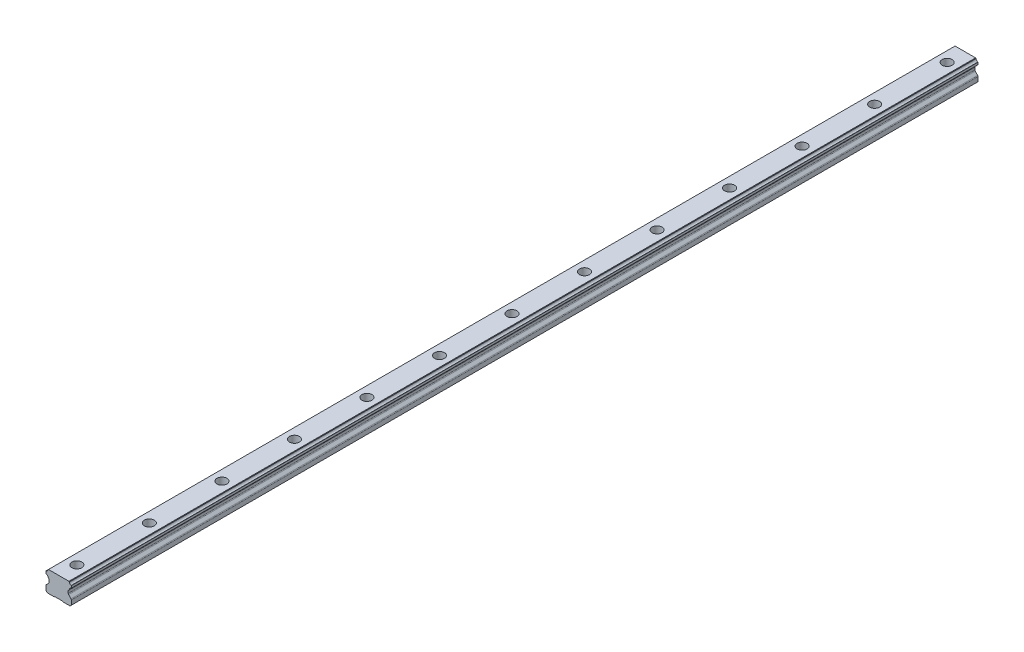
ISO-10303-21;
HEADER;
FILE_DESCRIPTION(('STEP AP214'),'2;1');
FILE_NAME('part.step','',(''),(''),'','','');
FILE_SCHEMA(('AUTOMOTIVE_DESIGN { 1 0 10303 214 1 1 1 1 }'));
ENDSEC;
DATA;
#1=APPLICATION_CONTEXT('core data for automotive mechanical design processes');
#2=APPLICATION_PROTOCOL_DEFINITION('international standard','automotive_design',2000,#1);
#3=PRODUCT_CONTEXT('',#1,'mechanical');
#4=PRODUCT('Part','Part','',(#3));
#5=PRODUCT_RELATED_PRODUCT_CATEGORY('part','',(#4));
#6=PRODUCT_DEFINITION_FORMATION('','',#4);
#7=PRODUCT_DEFINITION_CONTEXT('part definition',#1,'design');
#8=PRODUCT_DEFINITION('design','',#6,#7);
#9=PRODUCT_DEFINITION_SHAPE('','',#8);
#10=(LENGTH_UNIT() NAMED_UNIT(*) SI_UNIT(.MILLI.,.METRE.));
#11=(NAMED_UNIT(*) PLANE_ANGLE_UNIT() SI_UNIT($,.RADIAN.));
#12=(NAMED_UNIT(*) SI_UNIT($,.STERADIAN.) SOLID_ANGLE_UNIT());
#13=UNCERTAINTY_MEASURE_WITH_UNIT(LENGTH_MEASURE(1.E-05),#10,'distance_accuracy_value','');
#14=(GEOMETRIC_REPRESENTATION_CONTEXT(3) GLOBAL_UNCERTAINTY_ASSIGNED_CONTEXT((#13)) GLOBAL_UNIT_ASSIGNED_CONTEXT((#10,
#11,#12)) REPRESENTATION_CONTEXT('',''));
#15=CARTESIAN_POINT('',(0.,0.,0.));
#16=DIRECTION('',(0.,0.,1.));
#17=DIRECTION('',(1.,0.,0.));
#18=AXIS2_PLACEMENT_3D('',#15,#16,#17);
#19=CARTESIAN_POINT('',(14.3877733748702,11.5610047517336,1000.));
#20=DIRECTION('',(0.,0.,-1.));
#21=DIRECTION('',(-1.,0.,0.));
#22=AXIS2_PLACEMENT_3D('',#19,#20,#21);
#23=CYLINDRICAL_SURFACE('',#22,2.50000000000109);
#24=CARTESIAN_POINT('',(14.3877733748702,11.5610047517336,0.));
#25=DIRECTION('',(0.,0.,-1.));
#26=DIRECTION('',(1.,0.,0.));
#27=AXIS2_PLACEMENT_3D('',#24,#25,#26);
#28=CIRCLE('',#27,2.50000000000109);
#29=CARTESIAN_POINT('',(14.0248835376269,9.0874827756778,0.));
#30=VERTEX_POINT('',#29);
#31=CARTESIAN_POINT('',(11.910421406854,11.2252559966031,0.));
#32=VERTEX_POINT('',#31);
#33=EDGE_CURVE('E328',#30,#32,#28,.T.);
#34=ORIENTED_EDGE('',*,*,#33,.T.);
#35=DIRECTION('',(0.,0.,-1.));
#36=VECTOR('',#35,1.);
#37=CARTESIAN_POINT('',(11.910421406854,11.2252559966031,1000.));
#38=LINE('',#37,#36);
#39=CARTESIAN_POINT('',(11.910421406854,11.2252559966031,1000.));
#40=VERTEX_POINT('',#39);
#41=EDGE_CURVE('E12',#40,#32,#38,.T.);
#42=ORIENTED_EDGE('',*,*,#41,.F.);
#43=CARTESIAN_POINT('',(14.3877733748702,11.5610047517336,1000.));
#44=DIRECTION('',(0.,0.,-1.));
#45=DIRECTION('',(1.,0.,0.));
#46=AXIS2_PLACEMENT_3D('',#43,#44,#45);
#47=CIRCLE('',#46,2.50000000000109);
#48=CARTESIAN_POINT('',(14.0248835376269,9.0874827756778,1000.));
#49=VERTEX_POINT('',#48);
#50=EDGE_CURVE('E441',#49,#40,#47,.T.);
#51=ORIENTED_EDGE('',*,*,#50,.F.);
#52=DIRECTION('',(0.,0.,-1.));
#53=VECTOR('',#52,1.);
#54=CARTESIAN_POINT('',(14.0248835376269,9.0874827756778,1000.));
#55=LINE('',#54,#53);
#56=EDGE_CURVE('E324',#49,#30,#55,.T.);
#57=ORIENTED_EDGE('',*,*,#56,.T.);
#58=EDGE_LOOP('',(#34,#42,#51,#57));
#59=FACE_BOUND('',#58,.T.);
#60=ADVANCED_FACE('F45',(#59),#23,.F.);
#61=CARTESIAN_POINT('',(11.6783271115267,11.0351711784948,1000.));
#62=DIRECTION('',(0.,0.,-1.));
#63=DIRECTION('',(-1.,0.,0.));
#64=AXIS2_PLACEMENT_3D('',#61,#62,#63);
#65=CYLINDRICAL_SURFACE('',#64,0.299999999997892);
#66=CARTESIAN_POINT('',(11.6783271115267,11.0351711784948,0.));
#67=DIRECTION('',(0.,0.,1.));
#68=DIRECTION('',(1.,0.,0.));
#69=AXIS2_PLACEMENT_3D('',#66,#67,#68);
#70=CIRCLE('',#69,0.299999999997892);
#71=CARTESIAN_POINT('',(11.890459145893,11.2473032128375,0.));
#72=VERTEX_POINT('',#71);
#73=EDGE_CURVE('E332',#32,#72,#70,.T.);
#74=ORIENTED_EDGE('',*,*,#73,.T.);
#75=DIRECTION('',(0.,0.,-1.));
#76=VECTOR('',#75,1.);
#77=CARTESIAN_POINT('',(11.890459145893,11.2473032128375,1000.));
#78=LINE('',#77,#76);
#79=CARTESIAN_POINT('',(11.890459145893,11.2473032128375,1000.));
#80=VERTEX_POINT('',#79);
#81=EDGE_CURVE('E55',#80,#72,#78,.T.);
#82=ORIENTED_EDGE('',*,*,#81,.F.);
#83=CARTESIAN_POINT('',(11.6783271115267,11.0351711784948,1000.));
#84=DIRECTION('',(0.,0.,1.));
#85=DIRECTION('',(1.,0.,0.));
#86=AXIS2_PLACEMENT_3D('',#83,#84,#85);
#87=CIRCLE('',#86,0.299999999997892);
#88=EDGE_CURVE('E197',#40,#80,#87,.T.);
#89=ORIENTED_EDGE('',*,*,#88,.F.);
#90=ORIENTED_EDGE('',*,*,#41,.T.);
#91=EDGE_LOOP('',(#74,#82,#89,#90));
#92=FACE_BOUND('',#91,.T.);
#93=ADVANCED_FACE('F899',(#92),#65,.T.);
#94=CARTESIAN_POINT('',(11.890459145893,11.2473032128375,1000.));
#95=DIRECTION('',(-0.707106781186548,-0.707106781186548,0.));
#96=DIRECTION('',(0.707106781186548,-0.707106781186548,0.));
#97=AXIS2_PLACEMENT_3D('',#94,#95,#96);
#98=PLANE('',#97);
#99=DIRECTION('',(-0.707106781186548,0.707106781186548,0.));
#100=VECTOR('',#99,1.);
#101=CARTESIAN_POINT('',(11.890459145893,11.2473032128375,0.));
#102=LINE('',#101,#100);
#103=CARTESIAN_POINT('',(11.4322654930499,11.7054968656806,0.));
#104=VERTEX_POINT('',#103);
#105=EDGE_CURVE('E336',#72,#104,#102,.T.);
#106=ORIENTED_EDGE('',*,*,#105,.T.);
#107=DIRECTION('',(0.,0.,-1.));
#108=VECTOR('',#107,1.);
#109=CARTESIAN_POINT('',(11.4322654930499,11.7054968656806,1000.));
#110=LINE('',#109,#108);
#111=CARTESIAN_POINT('',(11.4322654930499,11.7054968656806,1000.));
#112=VERTEX_POINT('',#111);
#113=EDGE_CURVE('E572',#112,#104,#110,.T.);
#114=ORIENTED_EDGE('',*,*,#113,.F.);
#115=DIRECTION('',(-0.707106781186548,0.707106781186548,0.));
#116=VECTOR('',#115,1.);
#117=CARTESIAN_POINT('',(11.890459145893,11.2473032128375,1000.));
#118=LINE('',#117,#116);
#119=EDGE_CURVE('E775',#80,#112,#118,.T.);
#120=ORIENTED_EDGE('',*,*,#119,.F.);
#121=ORIENTED_EDGE('',*,*,#81,.T.);
#122=EDGE_LOOP('',(#106,#114,#120,#121));
#123=FACE_BOUND('',#122,.T.);
#124=ADVANCED_FACE('F903',(#123),#98,.F.);
#125=CARTESIAN_POINT('',(11.4322654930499,11.7054968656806,1000.));
#126=DIRECTION('',(0.,-1.,0.));
#127=DIRECTION('',(0.,0.,-1.));
#128=AXIS2_PLACEMENT_3D('',#125,#126,#127);
#129=PLANE('',#128);
#130=CARTESIAN_POINT('',(0.132265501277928,11.7054968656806,100.));
#131=DIRECTION('',(0.,1.,0.));
#132=DIRECTION('',(0.,0.,1.));
#133=AXIS2_PLACEMENT_3D('',#130,#131,#132);
#134=CIRCLE('',#133,5.49999999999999);
#135=CARTESIAN_POINT('',(0.132265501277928,11.7054968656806,105.5));
#136=VERTEX_POINT('',#135);
#137=EDGE_CURVE('E1823',#136,#136,#134,.T.);
#138=ORIENTED_EDGE('',*,*,#137,.F.);
#139=EDGE_LOOP('',(#138));
#140=FACE_BOUND('',#139,.T.);
#141=CARTESIAN_POINT('',(0.132265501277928,11.7054968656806,180.));
#142=DIRECTION('',(0.,1.,0.));
#143=DIRECTION('',(0.,0.,1.));
#144=AXIS2_PLACEMENT_3D('',#141,#142,#143);
#145=CIRCLE('',#144,5.49999999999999);
#146=CARTESIAN_POINT('',(0.132265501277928,11.7054968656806,185.5));
#147=VERTEX_POINT('',#146);
#148=EDGE_CURVE('E661',#147,#147,#145,.T.);
#149=ORIENTED_EDGE('',*,*,#148,.F.);
#150=EDGE_LOOP('',(#149));
#151=FACE_BOUND('',#150,.T.);
#152=CARTESIAN_POINT('',(0.132265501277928,11.7054968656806,260.));
#153=DIRECTION('',(0.,1.,0.));
#154=DIRECTION('',(0.,0.,1.));
#155=AXIS2_PLACEMENT_3D('',#152,#153,#154);
#156=CIRCLE('',#155,5.49999999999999);
#157=CARTESIAN_POINT('',(0.132265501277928,11.7054968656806,265.5));
#158=VERTEX_POINT('',#157);
#159=EDGE_CURVE('E645',#158,#158,#156,.T.);
#160=ORIENTED_EDGE('',*,*,#159,.F.);
#161=EDGE_LOOP('',(#160));
#162=FACE_BOUND('',#161,.T.);
#163=CARTESIAN_POINT('',(0.132265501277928,11.7054968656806,339.999999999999));
#164=DIRECTION('',(0.,1.,0.));
#165=DIRECTION('',(0.,0.,1.));
#166=AXIS2_PLACEMENT_3D('',#163,#164,#165);
#167=CIRCLE('',#166,5.49999999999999);
#168=CARTESIAN_POINT('',(0.132265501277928,11.7054968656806,345.499999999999));
#169=VERTEX_POINT('',#168);
#170=EDGE_CURVE('E640',#169,#169,#167,.T.);
#171=ORIENTED_EDGE('',*,*,#170,.F.);
#172=EDGE_LOOP('',(#171));
#173=FACE_BOUND('',#172,.T.);
#174=CARTESIAN_POINT('',(0.132265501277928,11.7054968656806,419.999999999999));
#175=DIRECTION('',(0.,1.,0.));
#176=DIRECTION('',(0.,0.,1.));
#177=AXIS2_PLACEMENT_3D('',#174,#175,#176);
#178=CIRCLE('',#177,5.49999999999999);
#179=CARTESIAN_POINT('',(0.132265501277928,11.7054968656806,425.499999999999));
#180=VERTEX_POINT('',#179);
#181=EDGE_CURVE('E635',#180,#180,#178,.T.);
#182=ORIENTED_EDGE('',*,*,#181,.F.);
#183=EDGE_LOOP('',(#182));
#184=FACE_BOUND('',#183,.T.);
#185=CARTESIAN_POINT('',(0.132265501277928,11.7054968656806,499.999999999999));
#186=DIRECTION('',(0.,1.,0.));
#187=DIRECTION('',(0.,0.,1.));
#188=AXIS2_PLACEMENT_3D('',#185,#186,#187);
#189=CIRCLE('',#188,5.49999999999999);
#190=CARTESIAN_POINT('',(0.132265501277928,11.7054968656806,505.499999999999));
#191=VERTEX_POINT('',#190);
#192=EDGE_CURVE('E629',#191,#191,#189,.T.);
#193=ORIENTED_EDGE('',*,*,#192,.F.);
#194=EDGE_LOOP('',(#193));
#195=FACE_BOUND('',#194,.T.);
#196=CARTESIAN_POINT('',(0.132265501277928,11.7054968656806,579.999999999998));
#197=DIRECTION('',(0.,1.,0.));
#198=DIRECTION('',(0.,0.,1.));
#199=AXIS2_PLACEMENT_3D('',#196,#197,#198);
#200=CIRCLE('',#199,5.49999999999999);
#201=CARTESIAN_POINT('',(0.132265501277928,11.7054968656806,585.499999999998));
#202=VERTEX_POINT('',#201);
#203=EDGE_CURVE('E623',#202,#202,#200,.T.);
#204=ORIENTED_EDGE('',*,*,#203,.F.);
#205=EDGE_LOOP('',(#204));
#206=FACE_BOUND('',#205,.T.);
#207=CARTESIAN_POINT('',(0.132265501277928,11.7054968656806,659.999999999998));
#208=DIRECTION('',(0.,1.,0.));
#209=DIRECTION('',(0.,0.,1.));
#210=AXIS2_PLACEMENT_3D('',#207,#208,#209);
#211=CIRCLE('',#210,5.49999999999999);
#212=CARTESIAN_POINT('',(0.132265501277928,11.7054968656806,665.499999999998));
#213=VERTEX_POINT('',#212);
#214=EDGE_CURVE('E617',#213,#213,#211,.T.);
#215=ORIENTED_EDGE('',*,*,#214,.F.);
#216=EDGE_LOOP('',(#215));
#217=FACE_BOUND('',#216,.T.);
#218=CARTESIAN_POINT('',(0.132265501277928,11.7054968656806,739.999999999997));
#219=DIRECTION('',(0.,1.,0.));
#220=DIRECTION('',(0.,0.,1.));
#221=AXIS2_PLACEMENT_3D('',#218,#219,#220);
#222=CIRCLE('',#221,5.49999999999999);
#223=CARTESIAN_POINT('',(0.132265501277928,11.7054968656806,745.499999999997));
#224=VERTEX_POINT('',#223);
#225=EDGE_CURVE('E611',#224,#224,#222,.T.);
#226=ORIENTED_EDGE('',*,*,#225,.F.);
#227=EDGE_LOOP('',(#226));
#228=FACE_BOUND('',#227,.T.);
#229=CARTESIAN_POINT('',(0.132265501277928,11.7054968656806,819.999999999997));
#230=DIRECTION('',(0.,1.,0.));
#231=DIRECTION('',(0.,0.,1.));
#232=AXIS2_PLACEMENT_3D('',#229,#230,#231);
#233=CIRCLE('',#232,5.49999999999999);
#234=CARTESIAN_POINT('',(0.132265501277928,11.7054968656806,825.499999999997));
#235=VERTEX_POINT('',#234);
#236=EDGE_CURVE('E605',#235,#235,#233,.T.);
#237=ORIENTED_EDGE('',*,*,#236,.F.);
#238=EDGE_LOOP('',(#237));
#239=FACE_BOUND('',#238,.T.);
#240=CARTESIAN_POINT('',(0.132265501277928,11.7054968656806,899.999999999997));
#241=DIRECTION('',(0.,1.,0.));
#242=DIRECTION('',(0.,0.,1.));
#243=AXIS2_PLACEMENT_3D('',#240,#241,#242);
#244=CIRCLE('',#243,5.49999999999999);
#245=CARTESIAN_POINT('',(0.132265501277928,11.7054968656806,905.499999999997));
#246=VERTEX_POINT('',#245);
#247=EDGE_CURVE('E599',#246,#246,#244,.T.);
#248=ORIENTED_EDGE('',*,*,#247,.F.);
#249=EDGE_LOOP('',(#248));
#250=FACE_BOUND('',#249,.T.);
#251=CARTESIAN_POINT('',(0.132265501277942,11.7054968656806,979.999999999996));
#252=DIRECTION('',(0.,1.,0.));
#253=DIRECTION('',(0.,0.,1.));
#254=AXIS2_PLACEMENT_3D('',#251,#252,#253);
#255=CIRCLE('',#254,5.49999999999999);
#256=CARTESIAN_POINT('',(0.132265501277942,11.7054968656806,985.499999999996));
#257=VERTEX_POINT('',#256);
#258=EDGE_CURVE('E593',#257,#257,#255,.T.);
#259=ORIENTED_EDGE('',*,*,#258,.F.);
#260=EDGE_LOOP('',(#259));
#261=FACE_BOUND('',#260,.T.);
#262=CARTESIAN_POINT('',(0.132265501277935,11.7054968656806,20.));
#263=DIRECTION('',(0.,1.,0.));
#264=DIRECTION('',(0.,0.,1.));
#265=AXIS2_PLACEMENT_3D('',#262,#263,#264);
#266=CIRCLE('',#265,5.49999999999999);
#267=CARTESIAN_POINT('',(0.132265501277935,11.7054968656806,25.5));
#268=VERTEX_POINT('',#267);
#269=EDGE_CURVE('E587',#268,#268,#266,.T.);
#270=ORIENTED_EDGE('',*,*,#269,.F.);
#271=EDGE_LOOP('',(#270));
#272=FACE_BOUND('',#271,.T.);
#273=DIRECTION('',(-1.,0.,0.));
#274=VECTOR('',#273,1.);
#275=CARTESIAN_POINT('',(11.4322654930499,11.7054968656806,0.));
#276=LINE('',#275,#274);
#277=CARTESIAN_POINT('',(-11.1677345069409,11.7054968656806,0.));
#278=VERTEX_POINT('',#277);
#279=EDGE_CURVE('E339',#104,#278,#276,.T.);
#280=ORIENTED_EDGE('',*,*,#279,.T.);
#281=DIRECTION('',(0.,0.,-1.));
#282=VECTOR('',#281,1.);
#283=CARTESIAN_POINT('',(-11.1677345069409,11.7054968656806,1000.));
#284=LINE('',#283,#282);
#285=CARTESIAN_POINT('',(-11.1677345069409,11.7054968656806,1000.));
#286=VERTEX_POINT('',#285);
#287=EDGE_CURVE('E568',#286,#278,#284,.T.);
#288=ORIENTED_EDGE('',*,*,#287,.F.);
#289=DIRECTION('',(-1.,0.,0.));
#290=VECTOR('',#289,1.);
#291=CARTESIAN_POINT('',(11.4322654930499,11.7054968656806,1000.));
#292=LINE('',#291,#290);
#293=EDGE_CURVE('E778',#112,#286,#292,.T.);
#294=ORIENTED_EDGE('',*,*,#293,.F.);
#295=ORIENTED_EDGE('',*,*,#113,.T.);
#296=EDGE_LOOP('',(#280,#288,#294,#295));
#297=FACE_BOUND('',#296,.T.);
#298=ADVANCED_FACE('F907',(#140,#151,#162,#173,#184,#195,#206,#217,#228,#239,#250,#261,#272,
#297),#129,.F.);
#299=CARTESIAN_POINT('',(-11.1677345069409,11.7054968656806,1000.));
#300=DIRECTION('',(0.707106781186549,-0.707106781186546,0.));
#301=DIRECTION('',(0.707106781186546,0.707106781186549,0.));
#302=AXIS2_PLACEMENT_3D('',#299,#300,#301);
#303=PLANE('',#302);
#304=DIRECTION('',(-0.707106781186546,-0.707106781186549,0.));
#305=VECTOR('',#304,1.);
#306=CARTESIAN_POINT('',(-11.1677345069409,11.7054968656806,0.));
#307=LINE('',#306,#305);
#308=CARTESIAN_POINT('',(-11.6259281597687,11.2473032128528,0.));
#309=VERTEX_POINT('',#308);
#310=EDGE_CURVE('E342',#278,#309,#307,.T.);
#311=ORIENTED_EDGE('',*,*,#310,.T.);
#312=DIRECTION('',(0.,0.,-1.));
#313=VECTOR('',#312,1.);
#314=CARTESIAN_POINT('',(-11.6259281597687,11.2473032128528,1000.));
#315=LINE('',#314,#313);
#316=CARTESIAN_POINT('',(-11.6259281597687,11.2473032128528,1000.));
#317=VERTEX_POINT('',#316);
#318=EDGE_CURVE('E564',#317,#309,#315,.T.);
#319=ORIENTED_EDGE('',*,*,#318,.F.);
#320=DIRECTION('',(-0.707106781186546,-0.707106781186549,0.));
#321=VECTOR('',#320,1.);
#322=CARTESIAN_POINT('',(-11.1677345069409,11.7054968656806,1000.));
#323=LINE('',#322,#321);
#324=EDGE_CURVE('E781',#286,#317,#323,.T.);
#325=ORIENTED_EDGE('',*,*,#324,.F.);
#326=ORIENTED_EDGE('',*,*,#287,.T.);
#327=EDGE_LOOP('',(#311,#319,#325,#326));
#328=FACE_BOUND('',#327,.T.);
#329=ADVANCED_FACE('F913',(#328),#303,.F.);
#330=CARTESIAN_POINT('',(-11.4137961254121,11.0351711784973,1000.));
#331=DIRECTION('',(0.,0.,-1.));
#332=DIRECTION('',(-1.,0.,0.));
#333=AXIS2_PLACEMENT_3D('',#330,#331,#332);
#334=CYLINDRICAL_SURFACE('',#333,0.30000000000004);
#335=CARTESIAN_POINT('',(-11.4137961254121,11.0351711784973,0.));
#336=DIRECTION('',(0.,0.,1.));
#337=DIRECTION('',(1.,0.,0.));
#338=AXIS2_PLACEMENT_3D('',#335,#336,#337);
#339=CIRCLE('',#338,0.30000000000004);
#340=CARTESIAN_POINT('',(-11.645890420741,11.2252559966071,0.));
#341=VERTEX_POINT('',#340);
#342=EDGE_CURVE('E345',#309,#341,#339,.T.);
#343=ORIENTED_EDGE('',*,*,#342,.T.);
#344=DIRECTION('',(0.,0.,-1.));
#345=VECTOR('',#344,1.);
#346=CARTESIAN_POINT('',(-11.645890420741,11.2252559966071,1000.));
#347=LINE('',#346,#345);
#348=CARTESIAN_POINT('',(-11.645890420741,11.2252559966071,1000.));
#349=VERTEX_POINT('',#348);
#350=EDGE_CURVE('E560',#349,#341,#347,.T.);
#351=ORIENTED_EDGE('',*,*,#350,.F.);
#352=CARTESIAN_POINT('',(-11.4137961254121,11.0351711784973,1000.));
#353=DIRECTION('',(0.,0.,1.));
#354=DIRECTION('',(1.,0.,0.));
#355=AXIS2_PLACEMENT_3D('',#352,#353,#354);
#356=CIRCLE('',#355,0.30000000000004);
#357=EDGE_CURVE('E784',#317,#349,#356,.T.);
#358=ORIENTED_EDGE('',*,*,#357,.F.);
#359=ORIENTED_EDGE('',*,*,#318,.T.);
#360=EDGE_LOOP('',(#343,#351,#358,#359));
#361=FACE_BOUND('',#360,.T.);
#362=ADVANCED_FACE('F917',(#361),#334,.T.);
#363=CARTESIAN_POINT('',(-14.1232423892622,11.5610047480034,1000.));
#364=DIRECTION('',(0.,0.,-1.));
#365=DIRECTION('',(-1.,0.,0.));
#366=AXIS2_PLACEMENT_3D('',#363,#364,#365);
#367=CYLINDRICAL_SURFACE('',#366,2.49999999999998);
#368=CARTESIAN_POINT('',(-14.1232423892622,11.5610047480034,0.));
#369=DIRECTION('',(0.,0.,-1.));
#370=DIRECTION('',(1.,0.,0.));
#371=AXIS2_PLACEMENT_3D('',#368,#369,#370);
#372=CIRCLE('',#371,2.49999999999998);
#373=CARTESIAN_POINT('',(-13.7603525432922,9.08748277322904,0.));
#374=VERTEX_POINT('',#373);
#375=EDGE_CURVE('E348',#341,#374,#372,.T.);
#376=ORIENTED_EDGE('',*,*,#375,.T.);
#377=DIRECTION('',(0.,0.,-1.));
#378=VECTOR('',#377,1.);
#379=CARTESIAN_POINT('',(-13.7603525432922,9.08748277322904,1000.));
#380=LINE('',#379,#378);
#381=CARTESIAN_POINT('',(-13.7603525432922,9.08748277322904,1000.));
#382=VERTEX_POINT('',#381);
#383=EDGE_CURVE('E556',#382,#374,#380,.T.);
#384=ORIENTED_EDGE('',*,*,#383,.F.);
#385=CARTESIAN_POINT('',(-14.1232423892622,11.5610047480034,1000.));
#386=DIRECTION('',(0.,0.,-1.));
#387=DIRECTION('',(1.,0.,0.));
#388=AXIS2_PLACEMENT_3D('',#385,#386,#387);
#389=CIRCLE('',#388,2.49999999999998);
#390=EDGE_CURVE('E787',#349,#382,#389,.T.);
#391=ORIENTED_EDGE('',*,*,#390,.F.);
#392=ORIENTED_EDGE('',*,*,#350,.T.);
#393=EDGE_LOOP('',(#376,#384,#391,#392));
#394=FACE_BOUND('',#393,.T.);
#395=ADVANCED_FACE('F921',(#394),#367,.F.);
#396=CARTESIAN_POINT('',(-13.5677345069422,8.85748648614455,1000.));
#397=DIRECTION('',(0.,0.,-1.));
#398=DIRECTION('',(-1.,0.,0.));
#399=AXIS2_PLACEMENT_3D('',#396,#397,#398);
#400=CYLINDRICAL_SURFACE('',#399,0.300000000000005);
#401=CARTESIAN_POINT('',(-13.5677345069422,8.85748648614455,0.));
#402=DIRECTION('',(0.,0.,1.));
#403=DIRECTION('',(1.,0.,0.));
#404=AXIS2_PLACEMENT_3D('',#401,#402,#403);
#405=CIRCLE('',#404,0.300000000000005);
#406=CARTESIAN_POINT('',(-13.8677345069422,8.85748648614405,0.));
#407=VERTEX_POINT('',#406);
#408=EDGE_CURVE('E351',#374,#407,#405,.T.);
#409=ORIENTED_EDGE('',*,*,#408,.T.);
#410=DIRECTION('',(0.,0.,-1.));
#411=VECTOR('',#410,1.);
#412=CARTESIAN_POINT('',(-13.8677345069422,8.85748648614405,1000.));
#413=LINE('',#412,#411);
#414=CARTESIAN_POINT('',(-13.8677345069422,8.85748648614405,1000.));
#415=VERTEX_POINT('',#414);
#416=EDGE_CURVE('E552',#415,#407,#413,.T.);
#417=ORIENTED_EDGE('',*,*,#416,.F.);
#418=CARTESIAN_POINT('',(-13.5677345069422,8.85748648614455,1000.));
#419=DIRECTION('',(0.,0.,1.));
#420=DIRECTION('',(1.,0.,0.));
#421=AXIS2_PLACEMENT_3D('',#418,#419,#420);
#422=CIRCLE('',#421,0.300000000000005);
#423=EDGE_CURVE('E790',#382,#415,#422,.T.);
#424=ORIENTED_EDGE('',*,*,#423,.F.);
#425=ORIENTED_EDGE('',*,*,#383,.T.);
#426=EDGE_LOOP('',(#409,#417,#424,#425));
#427=FACE_BOUND('',#426,.T.);
#428=ADVANCED_FACE('F925',(#427),#400,.T.);
#429=CARTESIAN_POINT('',(-13.8677345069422,8.85748648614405,1000.));
#430=DIRECTION('',(1.,0.,0.));
#431=DIRECTION('',(0.,0.,-1.));
#432=AXIS2_PLACEMENT_3D('',#429,#430,#431);
#433=PLANE('',#432);
#434=DIRECTION('',(0.,-1.,0.));
#435=VECTOR('',#434,1.);
#436=CARTESIAN_POINT('',(-13.8677345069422,8.85748648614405,0.));
#437=LINE('',#436,#435);
#438=CARTESIAN_POINT('',(-13.8677345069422,6.55350724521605,0.));
#439=VERTEX_POINT('',#438);
#440=EDGE_CURVE('E354',#407,#439,#437,.T.);
#441=ORIENTED_EDGE('',*,*,#440,.T.);
#442=DIRECTION('',(0.,0.,-1.));
#443=VECTOR('',#442,1.);
#444=CARTESIAN_POINT('',(-13.8677345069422,6.55350724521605,1000.));
#445=LINE('',#444,#443);
#446=CARTESIAN_POINT('',(-13.8677345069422,6.55350724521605,1000.));
#447=VERTEX_POINT('',#446);
#448=EDGE_CURVE('E548',#447,#439,#445,.T.);
#449=ORIENTED_EDGE('',*,*,#448,.F.);
#450=DIRECTION('',(0.,-1.,0.));
#451=VECTOR('',#450,1.);
#452=CARTESIAN_POINT('',(-13.8677345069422,8.85748648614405,1000.));
#453=LINE('',#452,#451);
#454=EDGE_CURVE('E793',#415,#447,#453,.T.);
#455=ORIENTED_EDGE('',*,*,#454,.F.);
#456=ORIENTED_EDGE('',*,*,#416,.T.);
#457=EDGE_LOOP('',(#441,#449,#455,#456));
#458=FACE_BOUND('',#457,.T.);
#459=ADVANCED_FACE('F929',(#458),#433,.F.);
#460=CARTESIAN_POINT('',(-13.5677345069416,6.55350724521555,1000.));
#461=DIRECTION('',(0.,0.,-1.));
#462=DIRECTION('',(-1.,0.,0.));
#463=AXIS2_PLACEMENT_3D('',#460,#461,#462);
#464=CYLINDRICAL_SURFACE('',#463,0.300000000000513);
#465=CARTESIAN_POINT('',(-13.5677345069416,6.55350724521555,0.));
#466=DIRECTION('',(0.,0.,1.));
#467=DIRECTION('',(1.,0.,0.));
#468=AXIS2_PLACEMENT_3D('',#465,#466,#467);
#469=CIRCLE('',#468,0.300000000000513);
#470=CARTESIAN_POINT('',(-13.7603525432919,6.32351095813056,0.));
#471=VERTEX_POINT('',#470);
#472=EDGE_CURVE('E357',#439,#471,#469,.T.);
#473=ORIENTED_EDGE('',*,*,#472,.T.);
#474=DIRECTION('',(0.,0.,-1.));
#475=VECTOR('',#474,1.);
#476=CARTESIAN_POINT('',(-13.7603525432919,6.32351095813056,1000.));
#477=LINE('',#476,#475);
#478=CARTESIAN_POINT('',(-13.7603525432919,6.32351095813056,1000.));
#479=VERTEX_POINT('',#478);
#480=EDGE_CURVE('E544',#479,#471,#477,.T.);
#481=ORIENTED_EDGE('',*,*,#480,.F.);
#482=CARTESIAN_POINT('',(-13.5677345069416,6.55350724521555,1000.));
#483=DIRECTION('',(0.,0.,1.));
#484=DIRECTION('',(1.,0.,0.));
#485=AXIS2_PLACEMENT_3D('',#482,#483,#484);
#486=CIRCLE('',#485,0.300000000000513);
#487=EDGE_CURVE('E796',#447,#479,#486,.T.);
#488=ORIENTED_EDGE('',*,*,#487,.F.);
#489=ORIENTED_EDGE('',*,*,#448,.T.);
#490=EDGE_LOOP('',(#473,#481,#488,#489));
#491=FACE_BOUND('',#490,.T.);
#492=ADVANCED_FACE('F933',(#491),#464,.T.);
#493=CARTESIAN_POINT('',(-14.1232423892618,3.84998898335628,1000.));
#494=DIRECTION('',(0.,0.,-1.));
#495=DIRECTION('',(-1.,0.,0.));
#496=AXIS2_PLACEMENT_3D('',#493,#494,#495);
#497=CYLINDRICAL_SURFACE('',#496,2.49999999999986);
#498=CARTESIAN_POINT('',(-14.1232423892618,3.84998898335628,0.));
#499=DIRECTION('',(0.,0.,-1.));
#500=DIRECTION('',(1.,0.,0.));
#501=AXIS2_PLACEMENT_3D('',#498,#499,#500);
#502=CIRCLE('',#501,2.49999999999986);
#503=CARTESIAN_POINT('',(-11.6458904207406,4.1857377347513,0.));
#504=VERTEX_POINT('',#503);
#505=EDGE_CURVE('E360',#471,#504,#502,.T.);
#506=ORIENTED_EDGE('',*,*,#505,.T.);
#507=DIRECTION('',(0.,0.,-1.));
#508=VECTOR('',#507,1.);
#509=CARTESIAN_POINT('',(-11.6458904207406,4.1857377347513,1000.));
#510=LINE('',#509,#508);
#511=CARTESIAN_POINT('',(-11.6458904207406,4.1857377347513,1000.));
#512=VERTEX_POINT('',#511);
#513=EDGE_CURVE('E540',#512,#504,#510,.T.);
#514=ORIENTED_EDGE('',*,*,#513,.F.);
#515=CARTESIAN_POINT('',(-14.1232423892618,3.84998898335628,1000.));
#516=DIRECTION('',(0.,0.,-1.));
#517=DIRECTION('',(1.,0.,0.));
#518=AXIS2_PLACEMENT_3D('',#515,#516,#517);
#519=CIRCLE('',#518,2.49999999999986);
#520=EDGE_CURVE('E799',#479,#512,#519,.T.);
#521=ORIENTED_EDGE('',*,*,#520,.F.);
#522=ORIENTED_EDGE('',*,*,#480,.T.);
#523=EDGE_LOOP('',(#506,#514,#521,#522));
#524=FACE_BOUND('',#523,.T.);
#525=ADVANCED_FACE('F937',(#524),#497,.F.);
#526=CARTESIAN_POINT('',(-11.4137961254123,4.37582255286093,1000.));
#527=DIRECTION('',(0.,0.,-1.));
#528=DIRECTION('',(-1.,0.,0.));
#529=AXIS2_PLACEMENT_3D('',#526,#527,#528);
#530=CYLINDRICAL_SURFACE('',#529,0.299999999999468);
#531=CARTESIAN_POINT('',(-11.4137961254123,4.37582255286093,0.));
#532=DIRECTION('',(0.,0.,1.));
#533=DIRECTION('',(1.,0.,0.));
#534=AXIS2_PLACEMENT_3D('',#531,#532,#533);
#535=CIRCLE('',#534,0.299999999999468);
#536=CARTESIAN_POINT('',(-11.6259281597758,4.16369051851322,0.));
#537=VERTEX_POINT('',#536);
#538=EDGE_CURVE('E363',#504,#537,#535,.T.);
#539=ORIENTED_EDGE('',*,*,#538,.T.);
#540=DIRECTION('',(0.,0.,-1.));
#541=VECTOR('',#540,1.);
#542=CARTESIAN_POINT('',(-11.6259281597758,4.16369051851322,1000.));
#543=LINE('',#542,#541);
#544=CARTESIAN_POINT('',(-11.6259281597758,4.16369051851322,1000.));
#545=VERTEX_POINT('',#544);
#546=EDGE_CURVE('E536',#545,#537,#543,.T.);
#547=ORIENTED_EDGE('',*,*,#546,.F.);
#548=CARTESIAN_POINT('',(-11.4137961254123,4.37582255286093,1000.));
#549=DIRECTION('',(0.,0.,1.));
#550=DIRECTION('',(1.,0.,0.));
#551=AXIS2_PLACEMENT_3D('',#548,#549,#550);
#552=CIRCLE('',#551,0.299999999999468);
#553=EDGE_CURVE('E802',#512,#545,#552,.T.);
#554=ORIENTED_EDGE('',*,*,#553,.F.);
#555=ORIENTED_EDGE('',*,*,#513,.T.);
#556=EDGE_LOOP('',(#539,#547,#554,#555));
#557=FACE_BOUND('',#556,.T.);
#558=ADVANCED_FACE('F941',(#557),#530,.T.);
#559=CARTESIAN_POINT('',(-11.6259281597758,4.16369051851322,1000.));
#560=DIRECTION('',(0.707106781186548,0.707106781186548,0.));
#561=DIRECTION('',(-0.707106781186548,0.707106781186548,0.));
#562=AXIS2_PLACEMENT_3D('',#559,#560,#561);
#563=PLANE('',#562);
#564=DIRECTION('',(0.707106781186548,-0.707106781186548,0.));
#565=VECTOR('',#564,1.);
#566=CARTESIAN_POINT('',(-11.6259281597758,4.16369051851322,0.));
#567=LINE('',#566,#565);
#568=CARTESIAN_POINT('',(-10.807074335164,3.34483669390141,0.));
#569=VERTEX_POINT('',#568);
#570=EDGE_CURVE('E366',#537,#569,#567,.T.);
#571=ORIENTED_EDGE('',*,*,#570,.T.);
#572=DIRECTION('',(0.,0.,-1.));
#573=VECTOR('',#572,1.);
#574=CARTESIAN_POINT('',(-10.807074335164,3.34483669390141,1000.));
#575=LINE('',#574,#573);
#576=CARTESIAN_POINT('',(-10.807074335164,3.34483669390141,1000.));
#577=VERTEX_POINT('',#576);
#578=EDGE_CURVE('E532',#577,#569,#575,.T.);
#579=ORIENTED_EDGE('',*,*,#578,.F.);
#580=DIRECTION('',(0.707106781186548,-0.707106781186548,0.));
#581=VECTOR('',#580,1.);
#582=CARTESIAN_POINT('',(-11.6259281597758,4.16369051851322,1000.));
#583=LINE('',#582,#581);
#584=EDGE_CURVE('E805',#545,#577,#583,.T.);
#585=ORIENTED_EDGE('',*,*,#584,.F.);
#586=ORIENTED_EDGE('',*,*,#546,.T.);
#587=EDGE_LOOP('',(#571,#579,#585,#586));
#588=FACE_BOUND('',#587,.T.);
#589=ADVANCED_FACE('F945',(#588),#563,.F.);
#590=CARTESIAN_POINT('',(-11.8677345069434,2.2841765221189,1000.));
#591=DIRECTION('',(0.,0.,-1.));
#592=DIRECTION('',(-1.,0.,0.));
#593=AXIS2_PLACEMENT_3D('',#590,#591,#592);
#594=CYLINDRICAL_SURFACE('',#593,1.50000000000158);
#595=CARTESIAN_POINT('',(-11.8677345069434,2.2841765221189,0.));
#596=DIRECTION('',(0.,0.,-1.));
#597=DIRECTION('',(1.,0.,0.));
#598=AXIS2_PLACEMENT_3D('',#595,#596,#597);
#599=CIRCLE('',#598,1.50000000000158);
#600=CARTESIAN_POINT('',(-10.3677345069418,2.28417652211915,0.));
#601=VERTEX_POINT('',#600);
#602=EDGE_CURVE('E369',#569,#601,#599,.T.);
#603=ORIENTED_EDGE('',*,*,#602,.T.);
#604=DIRECTION('',(0.,0.,-1.));
#605=VECTOR('',#604,1.);
#606=CARTESIAN_POINT('',(-10.3677345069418,2.28417652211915,1000.));
#607=LINE('',#606,#605);
#608=CARTESIAN_POINT('',(-10.3677345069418,2.28417652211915,1000.));
#609=VERTEX_POINT('',#608);
#610=EDGE_CURVE('E528',#609,#601,#607,.T.);
#611=ORIENTED_EDGE('',*,*,#610,.F.);
#612=CARTESIAN_POINT('',(-11.8677345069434,2.2841765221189,1000.));
#613=DIRECTION('',(0.,0.,-1.));
#614=DIRECTION('',(1.,0.,0.));
#615=AXIS2_PLACEMENT_3D('',#612,#613,#614);
#616=CIRCLE('',#615,1.50000000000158);
#617=EDGE_CURVE('E808',#577,#609,#616,.T.);
#618=ORIENTED_EDGE('',*,*,#617,.F.);
#619=ORIENTED_EDGE('',*,*,#578,.T.);
#620=EDGE_LOOP('',(#603,#611,#618,#619));
#621=FACE_BOUND('',#620,.T.);
#622=ADVANCED_FACE('F949',(#621),#594,.F.);
#623=CARTESIAN_POINT('',(-10.3677345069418,2.28417652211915,1000.));
#624=DIRECTION('',(1.,0.,0.));
#625=DIRECTION('',(0.,0.,-1.));
#626=AXIS2_PLACEMENT_3D('',#623,#624,#625);
#627=PLANE('',#626);
#628=DIRECTION('',(0.,-1.,0.));
#629=VECTOR('',#628,1.);
#630=CARTESIAN_POINT('',(-10.3677345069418,2.28417652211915,0.));
#631=LINE('',#630,#629);
#632=CARTESIAN_POINT('',(-10.3677345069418,-0.173349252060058,0.));
#633=VERTEX_POINT('',#632);
#634=EDGE_CURVE('E372',#601,#633,#631,.T.);
#635=ORIENTED_EDGE('',*,*,#634,.T.);
#636=DIRECTION('',(0.,0.,-1.));
#637=VECTOR('',#636,1.);
#638=CARTESIAN_POINT('',(-10.3677345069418,-0.173349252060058,1000.));
#639=LINE('',#638,#637);
#640=CARTESIAN_POINT('',(-10.3677345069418,-0.173349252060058,1000.));
#641=VERTEX_POINT('',#640);
#642=EDGE_CURVE('E524',#641,#633,#639,.T.);
#643=ORIENTED_EDGE('',*,*,#642,.F.);
#644=DIRECTION('',(0.,-1.,0.));
#645=VECTOR('',#644,1.);
#646=CARTESIAN_POINT('',(-10.3677345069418,2.28417652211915,1000.));
#647=LINE('',#646,#645);
#648=EDGE_CURVE('E811',#609,#641,#647,.T.);
#649=ORIENTED_EDGE('',*,*,#648,.F.);
#650=ORIENTED_EDGE('',*,*,#610,.T.);
#651=EDGE_LOOP('',(#635,#643,#649,#650));
#652=FACE_BOUND('',#651,.T.);
#653=ADVANCED_FACE('F953',(#652),#627,.F.);
#654=CARTESIAN_POINT('',(-11.8677345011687,-0.173182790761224,1000.));
#655=DIRECTION('',(0.,0.,-1.));
#656=DIRECTION('',(-1.,0.,0.));
#657=AXIS2_PLACEMENT_3D('',#654,#655,#656);
#658=CYLINDRICAL_SURFACE('',#657,1.50000000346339);
#659=CARTESIAN_POINT('',(-11.8677345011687,-0.173182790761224,0.));
#660=DIRECTION('',(0.,0.,-1.));
#661=DIRECTION('',(1.,0.,0.));
#662=AXIS2_PLACEMENT_3D('',#659,#660,#661);
#663=CIRCLE('',#662,1.50000000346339);
#664=CARTESIAN_POINT('',(-10.8070743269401,-1.23384296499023,0.));
#665=VERTEX_POINT('',#664);
#666=EDGE_CURVE('E375',#633,#665,#663,.T.);
#667=ORIENTED_EDGE('',*,*,#666,.T.);
#668=DIRECTION('',(0.,0.,-1.));
#669=VECTOR('',#668,1.);
#670=CARTESIAN_POINT('',(-10.8070743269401,-1.23384296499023,1000.));
#671=LINE('',#670,#669);
#672=CARTESIAN_POINT('',(-10.8070743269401,-1.23384296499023,1000.));
#673=VERTEX_POINT('',#672);
#674=EDGE_CURVE('E520',#673,#665,#671,.T.);
#675=ORIENTED_EDGE('',*,*,#674,.F.);
#676=CARTESIAN_POINT('',(-11.8677345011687,-0.173182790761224,1000.));
#677=DIRECTION('',(0.,0.,-1.));
#678=DIRECTION('',(1.,0.,0.));
#679=AXIS2_PLACEMENT_3D('',#676,#677,#678);
#680=CIRCLE('',#679,1.50000000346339);
#681=EDGE_CURVE('E814',#641,#673,#680,.T.);
#682=ORIENTED_EDGE('',*,*,#681,.F.);
#683=ORIENTED_EDGE('',*,*,#642,.T.);
#684=EDGE_LOOP('',(#667,#675,#682,#683));
#685=FACE_BOUND('',#684,.T.);
#686=ADVANCED_FACE('F957',(#685),#658,.F.);
#687=CARTESIAN_POINT('',(-10.8070743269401,-1.23384296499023,1000.));
#688=DIRECTION('',(0.707106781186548,-0.707106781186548,0.));
#689=DIRECTION('',(0.707106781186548,0.707106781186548,0.));
#690=AXIS2_PLACEMENT_3D('',#687,#688,#689);
#691=PLANE('',#690);
#692=DIRECTION('',(-0.707106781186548,-0.707106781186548,0.));
#693=VECTOR('',#692,1.);
#694=CARTESIAN_POINT('',(-10.8070743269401,-1.23384296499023,0.));
#695=LINE('',#694,#693);
#696=CARTESIAN_POINT('',(-13.4283946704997,-3.85516330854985,0.));
#697=VERTEX_POINT('',#696);
#698=EDGE_CURVE('E378',#665,#697,#695,.T.);
#699=ORIENTED_EDGE('',*,*,#698,.T.);
#700=DIRECTION('',(0.,0.,-1.));
#701=VECTOR('',#700,1.);
#702=CARTESIAN_POINT('',(-13.4283946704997,-3.85516330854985,1000.));
#703=LINE('',#702,#701);
#704=CARTESIAN_POINT('',(-13.4283946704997,-3.85516330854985,1000.));
#705=VERTEX_POINT('',#704);
#706=EDGE_CURVE('E516',#705,#697,#703,.T.);
#707=ORIENTED_EDGE('',*,*,#706,.F.);
#708=DIRECTION('',(-0.707106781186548,-0.707106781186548,0.));
#709=VECTOR('',#708,1.);
#710=CARTESIAN_POINT('',(-10.8070743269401,-1.23384296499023,1000.));
#711=LINE('',#710,#709);
#712=EDGE_CURVE('E817',#673,#705,#711,.T.);
#713=ORIENTED_EDGE('',*,*,#712,.F.);
#714=ORIENTED_EDGE('',*,*,#674,.T.);
#715=EDGE_LOOP('',(#699,#707,#713,#714));
#716=FACE_BOUND('',#715,.T.);
#717=ADVANCED_FACE('F961',(#716),#691,.F.);
#718=CARTESIAN_POINT('',(-12.3677344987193,-4.9158234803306,1000.));
#719=DIRECTION('',(0.,0.,-1.));
#720=DIRECTION('',(-1.,0.,0.));
#721=AXIS2_PLACEMENT_3D('',#718,#719,#720);
#722=CYLINDRICAL_SURFACE('',#721,1.50000000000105);
#723=CARTESIAN_POINT('',(-12.3677344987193,-4.9158234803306,0.));
#724=DIRECTION('',(0.,0.,1.));
#725=DIRECTION('',(1.,0.,0.));
#726=AXIS2_PLACEMENT_3D('',#723,#724,#725);
#727=CIRCLE('',#726,1.50000000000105);
#728=CARTESIAN_POINT('',(-13.8677344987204,-4.9158234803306,0.));
#729=VERTEX_POINT('',#728);
#730=EDGE_CURVE('E381',#697,#729,#727,.T.);
#731=ORIENTED_EDGE('',*,*,#730,.T.);
#732=DIRECTION('',(0.,0.,-1.));
#733=VECTOR('',#732,1.);
#734=CARTESIAN_POINT('',(-13.8677344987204,-4.9158234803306,1000.));
#735=LINE('',#734,#733);
#736=CARTESIAN_POINT('',(-13.8677344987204,-4.9158234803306,1000.));
#737=VERTEX_POINT('',#736);
#738=EDGE_CURVE('E512',#737,#729,#735,.T.);
#739=ORIENTED_EDGE('',*,*,#738,.F.);
#740=CARTESIAN_POINT('',(-12.3677344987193,-4.9158234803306,1000.));
#741=DIRECTION('',(0.,0.,1.));
#742=DIRECTION('',(1.,0.,0.));
#743=AXIS2_PLACEMENT_3D('',#740,#741,#742);
#744=CIRCLE('',#743,1.50000000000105);
#745=EDGE_CURVE('E820',#705,#737,#744,.T.);
#746=ORIENTED_EDGE('',*,*,#745,.F.);
#747=ORIENTED_EDGE('',*,*,#706,.T.);
#748=EDGE_LOOP('',(#731,#739,#746,#747));
#749=FACE_BOUND('',#748,.T.);
#750=ADVANCED_FACE('F965',(#749),#722,.T.);
#751=CARTESIAN_POINT('',(-13.8677344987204,-4.9158234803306,1000.));
#752=DIRECTION('',(1.,0.,0.));
#753=DIRECTION('',(0.,0.,-1.));
#754=AXIS2_PLACEMENT_3D('',#751,#752,#753);
#755=PLANE('',#754);
#756=DIRECTION('',(0.,-1.,0.));
#757=VECTOR('',#756,1.);
#758=CARTESIAN_POINT('',(-13.8677344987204,-4.9158234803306,0.));
#759=LINE('',#758,#757);
#760=CARTESIAN_POINT('',(-13.8677344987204,-9.7945031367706,0.));
#761=VERTEX_POINT('',#760);
#762=EDGE_CURVE('E384',#729,#761,#759,.T.);
#763=ORIENTED_EDGE('',*,*,#762,.T.);
#764=DIRECTION('',(0.,0.,-1.));
#765=VECTOR('',#764,1.);
#766=CARTESIAN_POINT('',(-13.8677344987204,-9.7945031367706,1000.));
#767=LINE('',#766,#765);
#768=CARTESIAN_POINT('',(-13.8677344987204,-9.7945031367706,1000.));
#769=VERTEX_POINT('',#768);
#770=EDGE_CURVE('E508',#769,#761,#767,.T.);
#771=ORIENTED_EDGE('',*,*,#770,.F.);
#772=DIRECTION('',(0.,-1.,0.));
#773=VECTOR('',#772,1.);
#774=CARTESIAN_POINT('',(-13.8677344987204,-4.9158234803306,1000.));
#775=LINE('',#774,#773);
#776=EDGE_CURVE('E823',#737,#769,#775,.T.);
#777=ORIENTED_EDGE('',*,*,#776,.F.);
#778=ORIENTED_EDGE('',*,*,#738,.T.);
#779=EDGE_LOOP('',(#763,#771,#777,#778));
#780=FACE_BOUND('',#779,.T.);
#781=ADVANCED_FACE('F969',(#780),#755,.F.);
#782=CARTESIAN_POINT('',(-13.8677344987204,-9.7945031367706,1000.));
#783=DIRECTION('',(0.707106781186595,0.7071067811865,0.));
#784=DIRECTION('',(-0.7071067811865,0.707106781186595,0.));
#785=AXIS2_PLACEMENT_3D('',#782,#783,#784);
#786=PLANE('',#785);
#787=DIRECTION('',(0.7071067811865,-0.707106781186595,0.));
#788=VECTOR('',#787,1.);
#789=CARTESIAN_POINT('',(-13.8677344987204,-9.7945031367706,0.));
#790=LINE('',#789,#788);
#791=CARTESIAN_POINT('',(-12.3677344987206,-11.2945031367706,0.));
#792=VERTEX_POINT('',#791);
#793=EDGE_CURVE('E387',#761,#792,#790,.T.);
#794=ORIENTED_EDGE('',*,*,#793,.T.);
#795=DIRECTION('',(0.,0.,-1.));
#796=VECTOR('',#795,1.);
#797=CARTESIAN_POINT('',(-12.3677344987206,-11.2945031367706,1000.));
#798=LINE('',#797,#796);
#799=CARTESIAN_POINT('',(-12.3677344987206,-11.2945031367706,1000.));
#800=VERTEX_POINT('',#799);
#801=EDGE_CURVE('E504',#800,#792,#798,.T.);
#802=ORIENTED_EDGE('',*,*,#801,.F.);
#803=DIRECTION('',(0.7071067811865,-0.707106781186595,0.));
#804=VECTOR('',#803,1.);
#805=CARTESIAN_POINT('',(-13.8677344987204,-9.7945031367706,1000.));
#806=LINE('',#805,#804);
#807=EDGE_CURVE('E826',#769,#800,#806,.T.);
#808=ORIENTED_EDGE('',*,*,#807,.F.);
#809=ORIENTED_EDGE('',*,*,#770,.T.);
#810=EDGE_LOOP('',(#794,#802,#808,#809));
#811=FACE_BOUND('',#810,.T.);
#812=ADVANCED_FACE('F973',(#811),#786,.F.);
#813=CARTESIAN_POINT('',(-12.3677344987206,-11.2945031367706,1000.));
#814=DIRECTION('',(0.,1.,0.));
#815=DIRECTION('',(0.,0.,1.));
#816=AXIS2_PLACEMENT_3D('',#813,#814,#815);
#817=PLANE('',#816);
#818=DIRECTION('',(1.,0.,0.));
#819=VECTOR('',#818,1.);
#820=CARTESIAN_POINT('',(-12.3677344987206,-11.2945031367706,0.));
#821=LINE('',#820,#819);
#822=CARTESIAN_POINT('',(-4.86773449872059,-11.2945031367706,0.));
#823=VERTEX_POINT('',#822);
#824=EDGE_CURVE('E390',#792,#823,#821,.T.);
#825=ORIENTED_EDGE('',*,*,#824,.T.);
#826=DIRECTION('',(0.,0.,-1.));
#827=VECTOR('',#826,1.);
#828=CARTESIAN_POINT('',(-4.86773449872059,-11.2945031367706,1000.));
#829=LINE('',#828,#827);
#830=CARTESIAN_POINT('',(-4.86773449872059,-11.2945031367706,1000.));
#831=VERTEX_POINT('',#830);
#832=EDGE_CURVE('E500',#831,#823,#829,.T.);
#833=ORIENTED_EDGE('',*,*,#832,.F.);
#834=DIRECTION('',(1.,0.,0.));
#835=VECTOR('',#834,1.);
#836=CARTESIAN_POINT('',(-12.3677344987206,-11.2945031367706,1000.));
#837=LINE('',#836,#835);
#838=EDGE_CURVE('E829',#800,#831,#837,.T.);
#839=ORIENTED_EDGE('',*,*,#838,.F.);
#840=ORIENTED_EDGE('',*,*,#801,.T.);
#841=EDGE_LOOP('',(#825,#833,#839,#840));
#842=FACE_BOUND('',#841,.T.);
#843=ADVANCED_FACE('F977',(#842),#817,.F.);
#844=CARTESIAN_POINT('',(-4.86773449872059,-11.2945031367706,1000.));
#845=DIRECTION('',(-0.707106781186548,0.707106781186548,0.));
#846=DIRECTION('',(-0.707106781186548,-0.707106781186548,0.));
#847=AXIS2_PLACEMENT_3D('',#844,#845,#846);
#848=PLANE('',#847);
#849=DIRECTION('',(0.707106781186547,0.707106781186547,0.));
#850=VECTOR('',#849,1.);
#851=CARTESIAN_POINT('',(-4.86773449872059,-11.2945031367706,0.));
#852=LINE('',#851,#850);
#853=CARTESIAN_POINT('',(-4.36773449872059,-10.7945031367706,0.));
#854=VERTEX_POINT('',#853);
#855=EDGE_CURVE('E393',#823,#854,#852,.T.);
#856=ORIENTED_EDGE('',*,*,#855,.T.);
#857=DIRECTION('',(0.,0.,-1.));
#858=VECTOR('',#857,1.);
#859=CARTESIAN_POINT('',(-4.36773449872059,-10.7945031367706,1000.));
#860=LINE('',#859,#858);
#861=CARTESIAN_POINT('',(-4.36773449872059,-10.7945031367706,1000.));
#862=VERTEX_POINT('',#861);
#863=EDGE_CURVE('E496',#862,#854,#860,.T.);
#864=ORIENTED_EDGE('',*,*,#863,.F.);
#865=DIRECTION('',(0.707106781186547,0.707106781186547,0.));
#866=VECTOR('',#865,1.);
#867=CARTESIAN_POINT('',(-4.86773449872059,-11.2945031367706,1000.));
#868=LINE('',#867,#866);
#869=EDGE_CURVE('E832',#831,#862,#868,.T.);
#870=ORIENTED_EDGE('',*,*,#869,.F.);
#871=ORIENTED_EDGE('',*,*,#832,.T.);
#872=EDGE_LOOP('',(#856,#864,#870,#871));
#873=FACE_BOUND('',#872,.T.);
#874=ADVANCED_FACE('F981',(#873),#848,.F.);
#875=CARTESIAN_POINT('',(-4.36773449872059,-10.7945031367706,1000.));
#876=DIRECTION('',(0.,1.,0.));
#877=DIRECTION('',(0.,0.,1.));
#878=AXIS2_PLACEMENT_3D('',#875,#876,#877);
#879=PLANE('',#878);
#880=CARTESIAN_POINT('',(0.132265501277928,-10.7945031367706,100.));
#881=DIRECTION('',(0.,1.,0.));
#882=DIRECTION('',(0.,0.,1.));
#883=AXIS2_PLACEMENT_3D('',#880,#881,#882);
#884=CIRCLE('',#883,3.5);
#885=CARTESIAN_POINT('',(0.132265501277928,-10.7945031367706,103.5));
#886=VERTEX_POINT('',#885);
#887=EDGE_CURVE('E48',#886,#886,#884,.T.);
#888=ORIENTED_EDGE('',*,*,#887,.T.);
#889=EDGE_LOOP('',(#888));
#890=FACE_BOUND('',#889,.T.);
#891=CARTESIAN_POINT('',(0.132265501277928,-10.7945031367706,180.));
#892=DIRECTION('',(0.,1.,0.));
#893=DIRECTION('',(0.,0.,1.));
#894=AXIS2_PLACEMENT_3D('',#891,#892,#893);
#895=CIRCLE('',#894,3.5);
#896=CARTESIAN_POINT('',(0.132265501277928,-10.7945031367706,183.5));
#897=VERTEX_POINT('',#896);
#898=EDGE_CURVE('E642',#897,#897,#895,.T.);
#899=ORIENTED_EDGE('',*,*,#898,.T.);
#900=EDGE_LOOP('',(#899));
#901=FACE_BOUND('',#900,.T.);
#902=CARTESIAN_POINT('',(0.132265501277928,-10.7945031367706,260.));
#903=DIRECTION('',(0.,1.,0.));
#904=DIRECTION('',(0.,0.,1.));
#905=AXIS2_PLACEMENT_3D('',#902,#903,#904);
#906=CIRCLE('',#905,3.5);
#907=CARTESIAN_POINT('',(0.132265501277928,-10.7945031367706,263.5));
#908=VERTEX_POINT('',#907);
#909=EDGE_CURVE('E637',#908,#908,#906,.T.);
#910=ORIENTED_EDGE('',*,*,#909,.T.);
#911=EDGE_LOOP('',(#910));
#912=FACE_BOUND('',#911,.T.);
#913=CARTESIAN_POINT('',(0.132265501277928,-10.7945031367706,339.999999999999));
#914=DIRECTION('',(0.,1.,0.));
#915=DIRECTION('',(0.,0.,1.));
#916=AXIS2_PLACEMENT_3D('',#913,#914,#915);
#917=CIRCLE('',#916,3.5);
#918=CARTESIAN_POINT('',(0.132265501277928,-10.7945031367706,343.499999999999));
#919=VERTEX_POINT('',#918);
#920=EDGE_CURVE('E631',#919,#919,#917,.T.);
#921=ORIENTED_EDGE('',*,*,#920,.T.);
#922=EDGE_LOOP('',(#921));
#923=FACE_BOUND('',#922,.T.);
#924=CARTESIAN_POINT('',(0.132265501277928,-10.7945031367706,419.999999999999));
#925=DIRECTION('',(0.,1.,0.));
#926=DIRECTION('',(0.,0.,1.));
#927=AXIS2_PLACEMENT_3D('',#924,#925,#926);
#928=CIRCLE('',#927,3.5);
#929=CARTESIAN_POINT('',(0.132265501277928,-10.7945031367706,423.499999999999));
#930=VERTEX_POINT('',#929);
#931=EDGE_CURVE('E625',#930,#930,#928,.T.);
#932=ORIENTED_EDGE('',*,*,#931,.T.);
#933=EDGE_LOOP('',(#932));
#934=FACE_BOUND('',#933,.T.);
#935=CARTESIAN_POINT('',(0.132265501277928,-10.7945031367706,499.999999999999));
#936=DIRECTION('',(0.,1.,0.));
#937=DIRECTION('',(0.,0.,1.));
#938=AXIS2_PLACEMENT_3D('',#935,#936,#937);
#939=CIRCLE('',#938,3.5);
#940=CARTESIAN_POINT('',(0.132265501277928,-10.7945031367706,503.499999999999));
#941=VERTEX_POINT('',#940);
#942=EDGE_CURVE('E619',#941,#941,#939,.T.);
#943=ORIENTED_EDGE('',*,*,#942,.T.);
#944=EDGE_LOOP('',(#943));
#945=FACE_BOUND('',#944,.T.);
#946=CARTESIAN_POINT('',(0.132265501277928,-10.7945031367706,579.999999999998));
#947=DIRECTION('',(0.,1.,0.));
#948=DIRECTION('',(0.,0.,1.));
#949=AXIS2_PLACEMENT_3D('',#946,#947,#948);
#950=CIRCLE('',#949,3.5);
#951=CARTESIAN_POINT('',(0.132265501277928,-10.7945031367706,583.499999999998));
#952=VERTEX_POINT('',#951);
#953=EDGE_CURVE('E613',#952,#952,#950,.T.);
#954=ORIENTED_EDGE('',*,*,#953,.T.);
#955=EDGE_LOOP('',(#954));
#956=FACE_BOUND('',#955,.T.);
#957=CARTESIAN_POINT('',(0.132265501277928,-10.7945031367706,659.999999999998));
#958=DIRECTION('',(0.,1.,0.));
#959=DIRECTION('',(0.,0.,1.));
#960=AXIS2_PLACEMENT_3D('',#957,#958,#959);
#961=CIRCLE('',#960,3.5);
#962=CARTESIAN_POINT('',(0.132265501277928,-10.7945031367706,663.499999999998));
#963=VERTEX_POINT('',#962);
#964=EDGE_CURVE('E607',#963,#963,#961,.T.);
#965=ORIENTED_EDGE('',*,*,#964,.T.);
#966=EDGE_LOOP('',(#965));
#967=FACE_BOUND('',#966,.T.);
#968=CARTESIAN_POINT('',(0.132265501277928,-10.7945031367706,739.999999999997));
#969=DIRECTION('',(0.,1.,0.));
#970=DIRECTION('',(0.,0.,1.));
#971=AXIS2_PLACEMENT_3D('',#968,#969,#970);
#972=CIRCLE('',#971,3.5);
#973=CARTESIAN_POINT('',(0.132265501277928,-10.7945031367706,743.499999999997));
#974=VERTEX_POINT('',#973);
#975=EDGE_CURVE('E601',#974,#974,#972,.T.);
#976=ORIENTED_EDGE('',*,*,#975,.T.);
#977=EDGE_LOOP('',(#976));
#978=FACE_BOUND('',#977,.T.);
#979=CARTESIAN_POINT('',(0.132265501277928,-10.7945031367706,819.999999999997));
#980=DIRECTION('',(0.,1.,0.));
#981=DIRECTION('',(0.,0.,1.));
#982=AXIS2_PLACEMENT_3D('',#979,#980,#981);
#983=CIRCLE('',#982,3.5);
#984=CARTESIAN_POINT('',(0.132265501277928,-10.7945031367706,823.499999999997));
#985=VERTEX_POINT('',#984);
#986=EDGE_CURVE('E595',#985,#985,#983,.T.);
#987=ORIENTED_EDGE('',*,*,#986,.T.);
#988=EDGE_LOOP('',(#987));
#989=FACE_BOUND('',#988,.T.);
#990=CARTESIAN_POINT('',(0.132265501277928,-10.7945031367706,899.999999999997));
#991=DIRECTION('',(0.,1.,0.));
#992=DIRECTION('',(0.,0.,1.));
#993=AXIS2_PLACEMENT_3D('',#990,#991,#992);
#994=CIRCLE('',#993,3.5);
#995=CARTESIAN_POINT('',(0.132265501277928,-10.7945031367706,903.499999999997));
#996=VERTEX_POINT('',#995);
#997=EDGE_CURVE('E589',#996,#996,#994,.T.);
#998=ORIENTED_EDGE('',*,*,#997,.T.);
#999=EDGE_LOOP('',(#998));
#1000=FACE_BOUND('',#999,.T.);
#1001=CARTESIAN_POINT('',(0.132265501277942,-10.7945031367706,979.999999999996));
#1002=DIRECTION('',(0.,1.,0.));
#1003=DIRECTION('',(0.,0.,1.));
#1004=AXIS2_PLACEMENT_3D('',#1001,#1002,#1003);
#1005=CIRCLE('',#1004,3.5);
#1006=CARTESIAN_POINT('',(0.132265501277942,-10.7945031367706,983.499999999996));
#1007=VERTEX_POINT('',#1006);
#1008=EDGE_CURVE('E583',#1007,#1007,#1005,.T.);
#1009=ORIENTED_EDGE('',*,*,#1008,.T.);
#1010=EDGE_LOOP('',(#1009));
#1011=FACE_BOUND('',#1010,.T.);
#1012=CARTESIAN_POINT('',(0.132265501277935,-10.7945031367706,20.));
#1013=DIRECTION('',(0.,1.,0.));
#1014=DIRECTION('',(0.,0.,1.));
#1015=AXIS2_PLACEMENT_3D('',#1012,#1013,#1014);
#1016=CIRCLE('',#1015,3.5);
#1017=CARTESIAN_POINT('',(0.132265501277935,-10.7945031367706,23.5));
#1018=VERTEX_POINT('',#1017);
#1019=EDGE_CURVE('E333',#1018,#1018,#1016,.T.);
#1020=ORIENTED_EDGE('',*,*,#1019,.T.);
#1021=EDGE_LOOP('',(#1020));
#1022=FACE_BOUND('',#1021,.T.);
#1023=DIRECTION('',(1.,0.,0.));
#1024=VECTOR('',#1023,1.);
#1025=CARTESIAN_POINT('',(-4.36773449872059,-10.7945031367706,0.));
#1026=LINE('',#1025,#1024);
#1027=CARTESIAN_POINT('',(4.63226550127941,-10.7945031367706,0.));
#1028=VERTEX_POINT('',#1027);
#1029=EDGE_CURVE('E396',#854,#1028,#1026,.T.);
#1030=ORIENTED_EDGE('',*,*,#1029,.T.);
#1031=DIRECTION('',(0.,0.,-1.));
#1032=VECTOR('',#1031,1.);
#1033=CARTESIAN_POINT('',(4.63226550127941,-10.7945031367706,1000.));
#1034=LINE('',#1033,#1032);
#1035=CARTESIAN_POINT('',(4.63226550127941,-10.7945031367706,1000.));
#1036=VERTEX_POINT('',#1035);
#1037=EDGE_CURVE('E492',#1036,#1028,#1034,.T.);
#1038=ORIENTED_EDGE('',*,*,#1037,.F.);
#1039=DIRECTION('',(1.,0.,0.));
#1040=VECTOR('',#1039,1.);
#1041=CARTESIAN_POINT('',(-4.36773449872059,-10.7945031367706,1000.));
#1042=LINE('',#1041,#1040);
#1043=EDGE_CURVE('E835',#862,#1036,#1042,.T.);
#1044=ORIENTED_EDGE('',*,*,#1043,.F.);
#1045=ORIENTED_EDGE('',*,*,#863,.T.);
#1046=EDGE_LOOP('',(#1030,#1038,#1044,#1045));
#1047=FACE_BOUND('',#1046,.T.);
#1048=ADVANCED_FACE('F985',(#890,#901,#912,#923,#934,#945,#956,#967,#978,#989,#1000,#1011,#1022,
#1047),#879,.F.);
#1049=CARTESIAN_POINT('',(4.63226550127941,-10.7945031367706,1000.));
#1050=DIRECTION('',(0.707106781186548,0.707106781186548,0.));
#1051=DIRECTION('',(-0.707106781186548,0.707106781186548,0.));
#1052=AXIS2_PLACEMENT_3D('',#1049,#1050,#1051);
#1053=PLANE('',#1052);
#1054=DIRECTION('',(0.707106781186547,-0.707106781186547,0.));
#1055=VECTOR('',#1054,1.);
#1056=CARTESIAN_POINT('',(4.63226550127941,-10.7945031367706,0.));
#1057=LINE('',#1056,#1055);
#1058=CARTESIAN_POINT('',(5.13226550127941,-11.2945031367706,0.));
#1059=VERTEX_POINT('',#1058);
#1060=EDGE_CURVE('E399',#1028,#1059,#1057,.T.);
#1061=ORIENTED_EDGE('',*,*,#1060,.T.);
#1062=DIRECTION('',(0.,0.,-1.));
#1063=VECTOR('',#1062,1.);
#1064=CARTESIAN_POINT('',(5.13226550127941,-11.2945031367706,1000.));
#1065=LINE('',#1064,#1063);
#1066=CARTESIAN_POINT('',(5.13226550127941,-11.2945031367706,1000.));
#1067=VERTEX_POINT('',#1066);
#1068=EDGE_CURVE('E488',#1067,#1059,#1065,.T.);
#1069=ORIENTED_EDGE('',*,*,#1068,.F.);
#1070=DIRECTION('',(0.707106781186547,-0.707106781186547,0.));
#1071=VECTOR('',#1070,1.);
#1072=CARTESIAN_POINT('',(4.63226550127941,-10.7945031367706,1000.));
#1073=LINE('',#1072,#1071);
#1074=EDGE_CURVE('E838',#1036,#1067,#1073,.T.);
#1075=ORIENTED_EDGE('',*,*,#1074,.F.);
#1076=ORIENTED_EDGE('',*,*,#1037,.T.);
#1077=EDGE_LOOP('',(#1061,#1069,#1075,#1076));
#1078=FACE_BOUND('',#1077,.T.);
#1079=ADVANCED_FACE('F989',(#1078),#1053,.F.);
#1080=CARTESIAN_POINT('',(5.13226550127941,-11.2945031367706,1000.));
#1081=DIRECTION('',(0.,1.,0.));
#1082=DIRECTION('',(0.,0.,1.));
#1083=AXIS2_PLACEMENT_3D('',#1080,#1081,#1082);
#1084=PLANE('',#1083);
#1085=DIRECTION('',(1.,0.,0.));
#1086=VECTOR('',#1085,1.);
#1087=CARTESIAN_POINT('',(5.13226550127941,-11.2945031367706,0.));
#1088=LINE('',#1087,#1086);
#1089=CARTESIAN_POINT('',(12.6322655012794,-11.2945031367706,0.));
#1090=VERTEX_POINT('',#1089);
#1091=EDGE_CURVE('E402',#1059,#1090,#1088,.T.);
#1092=ORIENTED_EDGE('',*,*,#1091,.T.);
#1093=DIRECTION('',(0.,0.,-1.));
#1094=VECTOR('',#1093,1.);
#1095=CARTESIAN_POINT('',(12.6322655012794,-11.2945031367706,1000.));
#1096=LINE('',#1095,#1094);
#1097=CARTESIAN_POINT('',(12.6322655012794,-11.2945031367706,1000.));
#1098=VERTEX_POINT('',#1097);
#1099=EDGE_CURVE('E484',#1098,#1090,#1096,.T.);
#1100=ORIENTED_EDGE('',*,*,#1099,.F.);
#1101=DIRECTION('',(1.,0.,0.));
#1102=VECTOR('',#1101,1.);
#1103=CARTESIAN_POINT('',(5.13226550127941,-11.2945031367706,1000.));
#1104=LINE('',#1103,#1102);
#1105=EDGE_CURVE('E841',#1067,#1098,#1104,.T.);
#1106=ORIENTED_EDGE('',*,*,#1105,.F.);
#1107=ORIENTED_EDGE('',*,*,#1068,.T.);
#1108=EDGE_LOOP('',(#1092,#1100,#1106,#1107));
#1109=FACE_BOUND('',#1108,.T.);
#1110=ADVANCED_FACE('F993',(#1109),#1084,.F.);
#1111=CARTESIAN_POINT('',(12.6322655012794,-11.2945031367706,1000.));
#1112=DIRECTION('',(-0.707106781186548,0.707106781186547,0.));
#1113=DIRECTION('',(-0.707106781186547,-0.707106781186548,0.));
#1114=AXIS2_PLACEMENT_3D('',#1111,#1112,#1113);
#1115=PLANE('',#1114);
#1116=DIRECTION('',(0.707106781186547,0.707106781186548,0.));
#1117=VECTOR('',#1116,1.);
#1118=CARTESIAN_POINT('',(12.6322655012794,-11.2945031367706,0.));
#1119=LINE('',#1118,#1117);
#1120=CARTESIAN_POINT('',(14.1322655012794,-9.7945031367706,0.));
#1121=VERTEX_POINT('',#1120);
#1122=EDGE_CURVE('E405',#1090,#1121,#1119,.T.);
#1123=ORIENTED_EDGE('',*,*,#1122,.T.);
#1124=DIRECTION('',(0.,0.,-1.));
#1125=VECTOR('',#1124,1.);
#1126=CARTESIAN_POINT('',(14.1322655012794,-9.7945031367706,1000.));
#1127=LINE('',#1126,#1125);
#1128=CARTESIAN_POINT('',(14.1322655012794,-9.7945031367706,1000.));
#1129=VERTEX_POINT('',#1128);
#1130=EDGE_CURVE('E480',#1129,#1121,#1127,.T.);
#1131=ORIENTED_EDGE('',*,*,#1130,.F.);
#1132=DIRECTION('',(0.707106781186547,0.707106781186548,0.));
#1133=VECTOR('',#1132,1.);
#1134=CARTESIAN_POINT('',(12.6322655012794,-11.2945031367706,1000.));
#1135=LINE('',#1134,#1133);
#1136=EDGE_CURVE('E844',#1098,#1129,#1135,.T.);
#1137=ORIENTED_EDGE('',*,*,#1136,.F.);
#1138=ORIENTED_EDGE('',*,*,#1099,.T.);
#1139=EDGE_LOOP('',(#1123,#1131,#1137,#1138));
#1140=FACE_BOUND('',#1139,.T.);
#1141=ADVANCED_FACE('F997',(#1140),#1115,.F.);
#1142=CARTESIAN_POINT('',(14.1322655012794,-9.7945031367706,1000.));
#1143=DIRECTION('',(-1.,0.,0.));
#1144=DIRECTION('',(0.,-1.,0.));
#1145=AXIS2_PLACEMENT_3D('',#1142,#1143,#1144);
#1146=PLANE('',#1145);
#1147=DIRECTION('',(0.,1.,0.));
#1148=VECTOR('',#1147,1.);
#1149=CARTESIAN_POINT('',(14.1322655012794,-9.7945031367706,0.));
#1150=LINE('',#1149,#1148);
#1151=CARTESIAN_POINT('',(14.1322655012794,-4.91565701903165,0.));
#1152=VERTEX_POINT('',#1151);
#1153=EDGE_CURVE('E408',#1121,#1152,#1150,.T.);
#1154=ORIENTED_EDGE('',*,*,#1153,.T.);
#1155=DIRECTION('',(0.,0.,-1.));
#1156=VECTOR('',#1155,1.);
#1157=CARTESIAN_POINT('',(14.1322655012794,-4.91565701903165,1000.));
#1158=LINE('',#1157,#1156);
#1159=CARTESIAN_POINT('',(14.1322655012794,-4.91565701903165,1000.));
#1160=VERTEX_POINT('',#1159);
#1161=EDGE_CURVE('E476',#1160,#1152,#1158,.T.);
#1162=ORIENTED_EDGE('',*,*,#1161,.F.);
#1163=DIRECTION('',(0.,1.,0.));
#1164=VECTOR('',#1163,1.);
#1165=CARTESIAN_POINT('',(14.1322655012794,-9.7945031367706,1000.));
#1166=LINE('',#1165,#1164);
#1167=EDGE_CURVE('E847',#1129,#1160,#1166,.T.);
#1168=ORIENTED_EDGE('',*,*,#1167,.F.);
#1169=ORIENTED_EDGE('',*,*,#1130,.T.);
#1170=EDGE_LOOP('',(#1154,#1162,#1168,#1169));
#1171=FACE_BOUND('',#1170,.T.);
#1172=ADVANCED_FACE('F1001',(#1171),#1146,.F.);
#1173=CARTESIAN_POINT('',(12.6322655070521,-4.91582348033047,1000.));
#1174=DIRECTION('',(0.,0.,-1.));
#1175=DIRECTION('',(-1.,0.,0.));
#1176=AXIS2_PLACEMENT_3D('',#1173,#1174,#1175);
#1177=CYLINDRICAL_SURFACE('',#1176,1.50000000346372);
#1178=CARTESIAN_POINT('',(12.6322655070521,-4.91582348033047,0.));
#1179=DIRECTION('',(0.,0.,1.));
#1180=DIRECTION('',(1.,0.,0.));
#1181=AXIS2_PLACEMENT_3D('',#1178,#1179,#1180);
#1182=CIRCLE('',#1181,1.50000000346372);
#1183=CARTESIAN_POINT('',(13.6929256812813,-3.85516330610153,0.));
#1184=VERTEX_POINT('',#1183);
#1185=EDGE_CURVE('E411',#1152,#1184,#1182,.T.);
#1186=ORIENTED_EDGE('',*,*,#1185,.T.);
#1187=DIRECTION('',(0.,0.,-1.));
#1188=VECTOR('',#1187,1.);
#1189=CARTESIAN_POINT('',(13.6929256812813,-3.85516330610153,1000.));
#1190=LINE('',#1189,#1188);
#1191=CARTESIAN_POINT('',(13.6929256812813,-3.85516330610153,1000.));
#1192=VERTEX_POINT('',#1191);
#1193=EDGE_CURVE('E472',#1192,#1184,#1190,.T.);
#1194=ORIENTED_EDGE('',*,*,#1193,.F.);
#1195=CARTESIAN_POINT('',(12.6322655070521,-4.91582348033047,1000.));
#1196=DIRECTION('',(0.,0.,1.));
#1197=DIRECTION('',(1.,0.,0.));
#1198=AXIS2_PLACEMENT_3D('',#1195,#1196,#1197);
#1199=CIRCLE('',#1198,1.50000000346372);
#1200=EDGE_CURVE('E850',#1160,#1192,#1199,.T.);
#1201=ORIENTED_EDGE('',*,*,#1200,.F.);
#1202=ORIENTED_EDGE('',*,*,#1161,.T.);
#1203=EDGE_LOOP('',(#1186,#1194,#1201,#1202));
#1204=FACE_BOUND('',#1203,.T.);
#1205=ADVANCED_FACE('F1005',(#1204),#1177,.T.);
#1206=CARTESIAN_POINT('',(13.6929256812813,-3.85516330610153,1000.));
#1207=DIRECTION('',(-0.707106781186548,-0.707106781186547,0.));
#1208=DIRECTION('',(0.707106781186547,-0.707106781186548,0.));
#1209=AXIS2_PLACEMENT_3D('',#1206,#1207,#1208);
#1210=PLANE('',#1209);
#1211=DIRECTION('',(-0.707106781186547,0.707106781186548,0.));
#1212=VECTOR('',#1211,1.);
#1213=CARTESIAN_POINT('',(13.6929256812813,-3.85516330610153,0.));
#1214=LINE('',#1213,#1212);
#1215=CARTESIAN_POINT('',(11.0716053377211,-1.23384296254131,0.));
#1216=VERTEX_POINT('',#1215);
#1217=EDGE_CURVE('E414',#1184,#1216,#1214,.T.);
#1218=ORIENTED_EDGE('',*,*,#1217,.T.);
#1219=DIRECTION('',(0.,0.,-1.));
#1220=VECTOR('',#1219,1.);
#1221=CARTESIAN_POINT('',(11.0716053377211,-1.23384296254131,1000.));
#1222=LINE('',#1221,#1220);
#1223=CARTESIAN_POINT('',(11.0716053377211,-1.23384296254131,1000.));
#1224=VERTEX_POINT('',#1223);
#1225=EDGE_CURVE('E468',#1224,#1216,#1222,.T.);
#1226=ORIENTED_EDGE('',*,*,#1225,.F.);
#1227=DIRECTION('',(-0.707106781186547,0.707106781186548,0.));
#1228=VECTOR('',#1227,1.);
#1229=CARTESIAN_POINT('',(13.6929256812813,-3.85516330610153,1000.));
#1230=LINE('',#1229,#1228);
#1231=EDGE_CURVE('E853',#1192,#1224,#1230,.T.);
#1232=ORIENTED_EDGE('',*,*,#1231,.F.);
#1233=ORIENTED_EDGE('',*,*,#1193,.T.);
#1234=EDGE_LOOP('',(#1218,#1226,#1232,#1233));
#1235=FACE_BOUND('',#1234,.T.);
#1236=ADVANCED_FACE('F1009',(#1235),#1210,.F.);
#1237=CARTESIAN_POINT('',(12.1322655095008,-0.173182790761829,1000.));
#1238=DIRECTION('',(0.,0.,-1.));
#1239=DIRECTION('',(-1.,0.,0.));
#1240=AXIS2_PLACEMENT_3D('',#1237,#1238,#1239);
#1241=CYLINDRICAL_SURFACE('',#1240,1.49999999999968);
#1242=CARTESIAN_POINT('',(12.1322655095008,-0.173182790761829,0.));
#1243=DIRECTION('',(0.,0.,-1.));
#1244=DIRECTION('',(1.,0.,0.));
#1245=AXIS2_PLACEMENT_3D('',#1242,#1243,#1244);
#1246=CIRCLE('',#1245,1.49999999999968);
#1247=CARTESIAN_POINT('',(10.6322655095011,-0.173182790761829,0.));
#1248=VERTEX_POINT('',#1247);
#1249=EDGE_CURVE('E417',#1216,#1248,#1246,.T.);
#1250=ORIENTED_EDGE('',*,*,#1249,.T.);
#1251=DIRECTION('',(0.,0.,-1.));
#1252=VECTOR('',#1251,1.);
#1253=CARTESIAN_POINT('',(10.6322655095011,-0.173182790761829,1000.));
#1254=LINE('',#1253,#1252);
#1255=CARTESIAN_POINT('',(10.6322655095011,-0.173182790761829,1000.));
#1256=VERTEX_POINT('',#1255);
#1257=EDGE_CURVE('E464',#1256,#1248,#1254,.T.);
#1258=ORIENTED_EDGE('',*,*,#1257,.F.);
#1259=CARTESIAN_POINT('',(12.1322655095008,-0.173182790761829,1000.));
#1260=DIRECTION('',(0.,0.,-1.));
#1261=DIRECTION('',(1.,0.,0.));
#1262=AXIS2_PLACEMENT_3D('',#1259,#1260,#1261);
#1263=CIRCLE('',#1262,1.49999999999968);
#1264=EDGE_CURVE('E856',#1224,#1256,#1263,.T.);
#1265=ORIENTED_EDGE('',*,*,#1264,.F.);
#1266=ORIENTED_EDGE('',*,*,#1225,.T.);
#1267=EDGE_LOOP('',(#1250,#1258,#1265,#1266));
#1268=FACE_BOUND('',#1267,.T.);
#1269=ADVANCED_FACE('F1013',(#1268),#1241,.F.);
#1270=CARTESIAN_POINT('',(10.6322655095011,-0.173182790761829,1000.));
#1271=DIRECTION('',(-1.,0.,0.));
#1272=DIRECTION('',(0.,0.,1.));
#1273=AXIS2_PLACEMENT_3D('',#1270,#1271,#1272);
#1274=PLANE('',#1273);
#1275=DIRECTION('',(0.,1.,0.));
#1276=VECTOR('',#1275,1.);
#1277=CARTESIAN_POINT('',(10.6322655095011,-0.173182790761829,0.));
#1278=LINE('',#1277,#1276);
#1279=CARTESIAN_POINT('',(10.6322655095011,2.28434298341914,0.));
#1280=VERTEX_POINT('',#1279);
#1281=EDGE_CURVE('E420',#1248,#1280,#1278,.T.);
#1282=ORIENTED_EDGE('',*,*,#1281,.T.);
#1283=DIRECTION('',(0.,0.,-1.));
#1284=VECTOR('',#1283,1.);
#1285=CARTESIAN_POINT('',(10.6322655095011,2.28434298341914,1000.));
#1286=LINE('',#1285,#1284);
#1287=CARTESIAN_POINT('',(10.6322655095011,2.28434298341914,1000.));
#1288=VERTEX_POINT('',#1287);
#1289=EDGE_CURVE('E460',#1288,#1280,#1286,.T.);
#1290=ORIENTED_EDGE('',*,*,#1289,.F.);
#1291=DIRECTION('',(0.,1.,0.));
#1292=VECTOR('',#1291,1.);
#1293=CARTESIAN_POINT('',(10.6322655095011,-0.173182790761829,1000.));
#1294=LINE('',#1293,#1292);
#1295=EDGE_CURVE('E859',#1256,#1288,#1294,.T.);
#1296=ORIENTED_EDGE('',*,*,#1295,.F.);
#1297=ORIENTED_EDGE('',*,*,#1257,.T.);
#1298=EDGE_LOOP('',(#1282,#1290,#1296,#1297));
#1299=FACE_BOUND('',#1298,.T.);
#1300=ADVANCED_FACE('F1017',(#1299),#1274,.F.);
#1301=CARTESIAN_POINT('',(12.1322655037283,2.2841765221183,1000.));
#1302=DIRECTION('',(0.,0.,-1.));
#1303=DIRECTION('',(-1.,0.,0.));
#1304=AXIS2_PLACEMENT_3D('',#1301,#1302,#1303);
#1305=CYLINDRICAL_SURFACE('',#1304,1.50000000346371);
#1306=CARTESIAN_POINT('',(12.1322655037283,2.2841765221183,0.));
#1307=DIRECTION('',(0.,0.,-1.));
#1308=DIRECTION('',(1.,0.,0.));
#1309=AXIS2_PLACEMENT_3D('',#1306,#1307,#1308);
#1310=CIRCLE('',#1309,1.50000000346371);
#1311=CARTESIAN_POINT('',(11.0716053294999,3.34483669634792,0.));
#1312=VERTEX_POINT('',#1311);
#1313=EDGE_CURVE('E423',#1280,#1312,#1310,.T.);
#1314=ORIENTED_EDGE('',*,*,#1313,.T.);
#1315=DIRECTION('',(0.,0.,-1.));
#1316=VECTOR('',#1315,1.);
#1317=CARTESIAN_POINT('',(11.0716053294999,3.34483669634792,1000.));
#1318=LINE('',#1317,#1316);
#1319=CARTESIAN_POINT('',(11.0716053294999,3.34483669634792,1000.));
#1320=VERTEX_POINT('',#1319);
#1321=EDGE_CURVE('E456',#1320,#1312,#1318,.T.);
#1322=ORIENTED_EDGE('',*,*,#1321,.F.);
#1323=CARTESIAN_POINT('',(12.1322655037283,2.2841765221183,1000.));
#1324=DIRECTION('',(0.,0.,-1.));
#1325=DIRECTION('',(1.,0.,0.));
#1326=AXIS2_PLACEMENT_3D('',#1323,#1324,#1325);
#1327=CIRCLE('',#1326,1.50000000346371);
#1328=EDGE_CURVE('E862',#1288,#1320,#1327,.T.);
#1329=ORIENTED_EDGE('',*,*,#1328,.F.);
#1330=ORIENTED_EDGE('',*,*,#1289,.T.);
#1331=EDGE_LOOP('',(#1314,#1322,#1329,#1330));
#1332=FACE_BOUND('',#1331,.T.);
#1333=ADVANCED_FACE('F1021',(#1332),#1305,.F.);
#1334=CARTESIAN_POINT('',(11.0716053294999,3.34483669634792,1000.));
#1335=DIRECTION('',(-0.707106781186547,0.707106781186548,0.));
#1336=DIRECTION('',(-0.707106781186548,-0.707106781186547,0.));
#1337=AXIS2_PLACEMENT_3D('',#1334,#1335,#1336);
#1338=PLANE('',#1337);
#1339=DIRECTION('',(0.707106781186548,0.707106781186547,0.));
#1340=VECTOR('',#1339,1.);
#1341=CARTESIAN_POINT('',(11.0716053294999,3.34483669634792,0.));
#1342=LINE('',#1341,#1340);
#1343=CARTESIAN_POINT('',(11.8904591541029,4.16369052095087,0.));
#1344=VERTEX_POINT('',#1343);
#1345=EDGE_CURVE('E426',#1312,#1344,#1342,.T.);
#1346=ORIENTED_EDGE('',*,*,#1345,.T.);
#1347=DIRECTION('',(0.,0.,-1.));
#1348=VECTOR('',#1347,1.);
#1349=CARTESIAN_POINT('',(11.8904591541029,4.16369052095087,1000.));
#1350=LINE('',#1349,#1348);
#1351=CARTESIAN_POINT('',(11.8904591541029,4.16369052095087,1000.));
#1352=VERTEX_POINT('',#1351);
#1353=EDGE_CURVE('E452',#1352,#1344,#1350,.T.);
#1354=ORIENTED_EDGE('',*,*,#1353,.F.);
#1355=DIRECTION('',(0.707106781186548,0.707106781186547,0.));
#1356=VECTOR('',#1355,1.);
#1357=CARTESIAN_POINT('',(11.0716053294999,3.34483669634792,1000.));
#1358=LINE('',#1357,#1356);
#1359=EDGE_CURVE('E865',#1320,#1352,#1358,.T.);
#1360=ORIENTED_EDGE('',*,*,#1359,.F.);
#1361=ORIENTED_EDGE('',*,*,#1321,.T.);
#1362=EDGE_LOOP('',(#1346,#1354,#1360,#1361));
#1363=FACE_BOUND('',#1362,.T.);
#1364=ADVANCED_FACE('F1025',(#1363),#1338,.F.);
#1365=CARTESIAN_POINT('',(11.6783271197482,4.37582255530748,1000.));
#1366=DIRECTION('',(0.,0.,-1.));
#1367=DIRECTION('',(-1.,0.,0.));
#1368=AXIS2_PLACEMENT_3D('',#1365,#1366,#1367);
#1369=CYLINDRICAL_SURFACE('',#1368,0.299999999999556);
#1370=CARTESIAN_POINT('',(11.6783271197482,4.37582255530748,0.));
#1371=DIRECTION('',(0.,0.,1.));
#1372=DIRECTION('',(1.,0.,0.));
#1373=AXIS2_PLACEMENT_3D('',#1370,#1371,#1372);
#1374=CIRCLE('',#1373,0.299999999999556);
#1375=CARTESIAN_POINT('',(11.9104214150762,4.18573773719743,0.));
#1376=VERTEX_POINT('',#1375);
#1377=EDGE_CURVE('E429',#1344,#1376,#1374,.T.);
#1378=ORIENTED_EDGE('',*,*,#1377,.T.);
#1379=DIRECTION('',(0.,0.,-1.));
#1380=VECTOR('',#1379,1.);
#1381=CARTESIAN_POINT('',(11.9104214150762,4.18573773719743,1000.));
#1382=LINE('',#1381,#1380);
#1383=CARTESIAN_POINT('',(11.9104214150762,4.18573773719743,1000.));
#1384=VERTEX_POINT('',#1383);
#1385=EDGE_CURVE('E448',#1384,#1376,#1382,.T.);
#1386=ORIENTED_EDGE('',*,*,#1385,.F.);
#1387=CARTESIAN_POINT('',(11.6783271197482,4.37582255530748,1000.));
#1388=DIRECTION('',(0.,0.,1.));
#1389=DIRECTION('',(1.,0.,0.));
#1390=AXIS2_PLACEMENT_3D('',#1387,#1388,#1389);
#1391=CIRCLE('',#1390,0.299999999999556);
#1392=EDGE_CURVE('E868',#1352,#1384,#1391,.T.);
#1393=ORIENTED_EDGE('',*,*,#1392,.F.);
#1394=ORIENTED_EDGE('',*,*,#1353,.T.);
#1395=EDGE_LOOP('',(#1378,#1386,#1393,#1394));
#1396=FACE_BOUND('',#1395,.T.);
#1397=ADVANCED_FACE('F876',(#1396),#1369,.T.);
#1398=CARTESIAN_POINT('',(14.3877733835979,3.84998898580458,1000.));
#1399=DIRECTION('',(0.,0.,-1.));
#1400=DIRECTION('',(-1.,0.,0.));
#1401=AXIS2_PLACEMENT_3D('',#1398,#1399,#1400);
#1402=CYLINDRICAL_SURFACE('',#1401,2.50000000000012);
#1403=CARTESIAN_POINT('',(14.3877733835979,3.84998898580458,0.));
#1404=DIRECTION('',(0.,0.,-1.));
#1405=DIRECTION('',(1.,0.,0.));
#1406=AXIS2_PLACEMENT_3D('',#1403,#1404,#1405);
#1407=CIRCLE('',#1406,2.50000000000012);
#1408=CARTESIAN_POINT('',(14.0248835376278,6.32351096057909,0.));
#1409=VERTEX_POINT('',#1408);
#1410=EDGE_CURVE('E432',#1376,#1409,#1407,.T.);
#1411=ORIENTED_EDGE('',*,*,#1410,.T.);
#1412=DIRECTION('',(0.,0.,-1.));
#1413=VECTOR('',#1412,1.);
#1414=CARTESIAN_POINT('',(14.0248835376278,6.32351096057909,1000.));
#1415=LINE('',#1414,#1413);
#1416=CARTESIAN_POINT('',(14.0248835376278,6.32351096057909,1000.));
#1417=VERTEX_POINT('',#1416);
#1418=EDGE_CURVE('E317',#1417,#1409,#1415,.T.);
#1419=ORIENTED_EDGE('',*,*,#1418,.F.);
#1420=CARTESIAN_POINT('',(14.3877733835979,3.84998898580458,1000.));
#1421=DIRECTION('',(0.,0.,-1.));
#1422=DIRECTION('',(1.,0.,0.));
#1423=AXIS2_PLACEMENT_3D('',#1420,#1421,#1422);
#1424=CIRCLE('',#1423,2.50000000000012);
#1425=EDGE_CURVE('E306',#1384,#1417,#1424,.T.);
#1426=ORIENTED_EDGE('',*,*,#1425,.F.);
#1427=ORIENTED_EDGE('',*,*,#1385,.T.);
#1428=EDGE_LOOP('',(#1411,#1419,#1426,#1427));
#1429=FACE_BOUND('',#1428,.T.);
#1430=ADVANCED_FACE('F880',(#1429),#1402,.F.);
#1431=CARTESIAN_POINT('',(13.8322655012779,6.55350724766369,1000.));
#1432=DIRECTION('',(0.,0.,-1.));
#1433=DIRECTION('',(-1.,0.,0.));
#1434=AXIS2_PLACEMENT_3D('',#1431,#1432,#1433);
#1435=CYLINDRICAL_SURFACE('',#1434,0.300000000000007);
#1436=CARTESIAN_POINT('',(13.8322655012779,6.55350724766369,0.));
#1437=DIRECTION('',(0.,0.,1.));
#1438=DIRECTION('',(1.,0.,0.));
#1439=AXIS2_PLACEMENT_3D('',#1436,#1437,#1438);
#1440=CIRCLE('',#1439,0.300000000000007);
#1441=CARTESIAN_POINT('',(14.1322655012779,6.55350724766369,0.));
#1442=VERTEX_POINT('',#1441);
#1443=EDGE_CURVE('E315',#1409,#1442,#1440,.T.);
#1444=ORIENTED_EDGE('',*,*,#1443,.T.);
#1445=DIRECTION('',(0.,0.,-1.));
#1446=VECTOR('',#1445,1.);
#1447=CARTESIAN_POINT('',(14.1322655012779,6.55350724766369,1000.));
#1448=LINE('',#1447,#1446);
#1449=CARTESIAN_POINT('',(14.1322655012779,6.55350724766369,1000.));
#1450=VERTEX_POINT('',#1449);
#1451=EDGE_CURVE('E312',#1450,#1442,#1448,.T.);
#1452=ORIENTED_EDGE('',*,*,#1451,.F.);
#1453=CARTESIAN_POINT('',(13.8322655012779,6.55350724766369,1000.));
#1454=DIRECTION('',(0.,0.,1.));
#1455=DIRECTION('',(1.,0.,0.));
#1456=AXIS2_PLACEMENT_3D('',#1453,#1454,#1455);
#1457=CIRCLE('',#1456,0.300000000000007);
#1458=EDGE_CURVE('E300',#1417,#1450,#1457,.T.);
#1459=ORIENTED_EDGE('',*,*,#1458,.F.);
#1460=ORIENTED_EDGE('',*,*,#1418,.T.);
#1461=EDGE_LOOP('',(#1444,#1452,#1459,#1460));
#1462=FACE_BOUND('',#1461,.T.);
#1463=ADVANCED_FACE('F313',(#1462),#1435,.T.);
#1464=CARTESIAN_POINT('',(14.1322655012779,6.55350724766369,1000.));
#1465=DIRECTION('',(-1.,0.,0.));
#1466=DIRECTION('',(0.,0.,1.));
#1467=AXIS2_PLACEMENT_3D('',#1464,#1465,#1466);
#1468=PLANE('',#1467);
#1469=DIRECTION('',(0.,1.,0.));
#1470=VECTOR('',#1469,1.);
#1471=CARTESIAN_POINT('',(14.1322655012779,6.55350724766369,0.));
#1472=LINE('',#1471,#1470);
#1473=CARTESIAN_POINT('',(14.1322655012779,8.85748648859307,0.));
#1474=VERTEX_POINT('',#1473);
#1475=EDGE_CURVE('E183',#1442,#1474,#1472,.T.);
#1476=ORIENTED_EDGE('',*,*,#1475,.T.);
#1477=DIRECTION('',(0.,0.,-1.));
#1478=VECTOR('',#1477,1.);
#1479=CARTESIAN_POINT('',(14.1322655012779,8.85748648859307,1000.));
#1480=LINE('',#1479,#1478);
#1481=CARTESIAN_POINT('',(14.1322655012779,8.85748648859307,1000.));
#1482=VERTEX_POINT('',#1481);
#1483=EDGE_CURVE('E318',#1482,#1474,#1480,.T.);
#1484=ORIENTED_EDGE('',*,*,#1483,.F.);
#1485=DIRECTION('',(0.,1.,0.));
#1486=VECTOR('',#1485,1.);
#1487=CARTESIAN_POINT('',(14.1322655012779,6.55350724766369,1000.));
#1488=LINE('',#1487,#1486);
#1489=EDGE_CURVE('E304',#1450,#1482,#1488,.T.);
#1490=ORIENTED_EDGE('',*,*,#1489,.F.);
#1491=ORIENTED_EDGE('',*,*,#1451,.T.);
#1492=EDGE_LOOP('',(#1476,#1484,#1490,#1491));
#1493=FACE_BOUND('',#1492,.T.);
#1494=ADVANCED_FACE('F320',(#1493),#1468,.F.);
#1495=CARTESIAN_POINT('',(13.8322655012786,8.85748648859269,1000.));
#1496=DIRECTION('',(0.,0.,-1.));
#1497=DIRECTION('',(-1.,0.,0.));
#1498=AXIS2_PLACEMENT_3D('',#1495,#1496,#1497);
#1499=CYLINDRICAL_SURFACE('',#1498,0.299999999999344);
#1500=CARTESIAN_POINT('',(13.8322655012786,8.85748648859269,0.));
#1501=DIRECTION('',(0.,0.,1.));
#1502=DIRECTION('',(1.,0.,0.));
#1503=AXIS2_PLACEMENT_3D('',#1500,#1501,#1502);
#1504=CIRCLE('',#1503,0.299999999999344);
#1505=EDGE_CURVE('E189',#1474,#30,#1504,.T.);
#1506=ORIENTED_EDGE('',*,*,#1505,.T.);
#1507=ORIENTED_EDGE('',*,*,#56,.F.);
#1508=CARTESIAN_POINT('',(13.8322655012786,8.85748648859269,1000.));
#1509=DIRECTION('',(0.,0.,1.));
#1510=DIRECTION('',(1.,0.,0.));
#1511=AXIS2_PLACEMENT_3D('',#1508,#1509,#1510);
#1512=CIRCLE('',#1511,0.299999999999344);
#1513=EDGE_CURVE('E64',#1482,#49,#1512,.T.);
#1514=ORIENTED_EDGE('',*,*,#1513,.F.);
#1515=ORIENTED_EDGE('',*,*,#1483,.T.);
#1516=EDGE_LOOP('',(#1506,#1507,#1514,#1515));
#1517=FACE_BOUND('',#1516,.T.);
#1518=ADVANCED_FACE('F888',(#1517),#1499,.T.);
#1519=CARTESIAN_POINT('',(14.3877733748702,11.5610047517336,1000.));
#1520=DIRECTION('',(0.,0.,1.));
#1521=DIRECTION('',(1.,0.,0.));
#1522=AXIS2_PLACEMENT_3D('',#1519,#1520,#1521);
#1523=PLANE('',#1522);
#1524=ORIENTED_EDGE('',*,*,#50,.T.);
#1525=ORIENTED_EDGE('',*,*,#88,.T.);
#1526=ORIENTED_EDGE('',*,*,#119,.T.);
#1527=ORIENTED_EDGE('',*,*,#293,.T.);
#1528=ORIENTED_EDGE('',*,*,#324,.T.);
#1529=ORIENTED_EDGE('',*,*,#357,.T.);
#1530=ORIENTED_EDGE('',*,*,#390,.T.);
#1531=ORIENTED_EDGE('',*,*,#423,.T.);
#1532=ORIENTED_EDGE('',*,*,#454,.T.);
#1533=ORIENTED_EDGE('',*,*,#487,.T.);
#1534=ORIENTED_EDGE('',*,*,#520,.T.);
#1535=ORIENTED_EDGE('',*,*,#553,.T.);
#1536=ORIENTED_EDGE('',*,*,#584,.T.);
#1537=ORIENTED_EDGE('',*,*,#617,.T.);
#1538=ORIENTED_EDGE('',*,*,#648,.T.);
#1539=ORIENTED_EDGE('',*,*,#681,.T.);
#1540=ORIENTED_EDGE('',*,*,#712,.T.);
#1541=ORIENTED_EDGE('',*,*,#745,.T.);
#1542=ORIENTED_EDGE('',*,*,#776,.T.);
#1543=ORIENTED_EDGE('',*,*,#807,.T.);
#1544=ORIENTED_EDGE('',*,*,#838,.T.);
#1545=ORIENTED_EDGE('',*,*,#869,.T.);
#1546=ORIENTED_EDGE('',*,*,#1043,.T.);
#1547=ORIENTED_EDGE('',*,*,#1074,.T.);
#1548=ORIENTED_EDGE('',*,*,#1105,.T.);
#1549=ORIENTED_EDGE('',*,*,#1136,.T.);
#1550=ORIENTED_EDGE('',*,*,#1167,.T.);
#1551=ORIENTED_EDGE('',*,*,#1200,.T.);
#1552=ORIENTED_EDGE('',*,*,#1231,.T.);
#1553=ORIENTED_EDGE('',*,*,#1264,.T.);
#1554=ORIENTED_EDGE('',*,*,#1295,.T.);
#1555=ORIENTED_EDGE('',*,*,#1328,.T.);
#1556=ORIENTED_EDGE('',*,*,#1359,.T.);
#1557=ORIENTED_EDGE('',*,*,#1392,.T.);
#1558=ORIENTED_EDGE('',*,*,#1425,.T.);
#1559=ORIENTED_EDGE('',*,*,#1458,.T.);
#1560=ORIENTED_EDGE('',*,*,#1489,.T.);
#1561=ORIENTED_EDGE('',*,*,#1513,.T.);
#1562=EDGE_LOOP('',(#1524,#1525,#1526,#1527,#1528,#1529,#1530,#1531,#1532,#1533,#1534,#1535,
#1536,#1537,#1538,#1539,#1540,#1541,#1542,#1543,#1544,#1545,#1546,#1547,#1548,#1549,#1550,#1551,
#1552,#1553,#1554,#1555,#1556,#1557,#1558,#1559,#1560,#1561));
#1563=FACE_BOUND('',#1562,.T.);
#1564=ADVANCED_FACE('F302',(#1563),#1523,.T.);
#1565=CARTESIAN_POINT('',(14.3877733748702,11.5610047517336,0.));
#1566=DIRECTION('',(0.,0.,1.));
#1567=DIRECTION('',(1.,0.,0.));
#1568=AXIS2_PLACEMENT_3D('',#1565,#1566,#1567);
#1569=PLANE('',#1568);
#1570=ORIENTED_EDGE('',*,*,#33,.F.);
#1571=ORIENTED_EDGE('',*,*,#1505,.F.);
#1572=ORIENTED_EDGE('',*,*,#1475,.F.);
#1573=ORIENTED_EDGE('',*,*,#1443,.F.);
#1574=ORIENTED_EDGE('',*,*,#1410,.F.);
#1575=ORIENTED_EDGE('',*,*,#1377,.F.);
#1576=ORIENTED_EDGE('',*,*,#1345,.F.);
#1577=ORIENTED_EDGE('',*,*,#1313,.F.);
#1578=ORIENTED_EDGE('',*,*,#1281,.F.);
#1579=ORIENTED_EDGE('',*,*,#1249,.F.);
#1580=ORIENTED_EDGE('',*,*,#1217,.F.);
#1581=ORIENTED_EDGE('',*,*,#1185,.F.);
#1582=ORIENTED_EDGE('',*,*,#1153,.F.);
#1583=ORIENTED_EDGE('',*,*,#1122,.F.);
#1584=ORIENTED_EDGE('',*,*,#1091,.F.);
#1585=ORIENTED_EDGE('',*,*,#1060,.F.);
#1586=ORIENTED_EDGE('',*,*,#1029,.F.);
#1587=ORIENTED_EDGE('',*,*,#855,.F.);
#1588=ORIENTED_EDGE('',*,*,#824,.F.);
#1589=ORIENTED_EDGE('',*,*,#793,.F.);
#1590=ORIENTED_EDGE('',*,*,#762,.F.);
#1591=ORIENTED_EDGE('',*,*,#730,.F.);
#1592=ORIENTED_EDGE('',*,*,#698,.F.);
#1593=ORIENTED_EDGE('',*,*,#666,.F.);
#1594=ORIENTED_EDGE('',*,*,#634,.F.);
#1595=ORIENTED_EDGE('',*,*,#602,.F.);
#1596=ORIENTED_EDGE('',*,*,#570,.F.);
#1597=ORIENTED_EDGE('',*,*,#538,.F.);
#1598=ORIENTED_EDGE('',*,*,#505,.F.);
#1599=ORIENTED_EDGE('',*,*,#472,.F.);
#1600=ORIENTED_EDGE('',*,*,#440,.F.);
#1601=ORIENTED_EDGE('',*,*,#408,.F.);
#1602=ORIENTED_EDGE('',*,*,#375,.F.);
#1603=ORIENTED_EDGE('',*,*,#342,.F.);
#1604=ORIENTED_EDGE('',*,*,#310,.F.);
#1605=ORIENTED_EDGE('',*,*,#279,.F.);
#1606=ORIENTED_EDGE('',*,*,#105,.F.);
#1607=ORIENTED_EDGE('',*,*,#73,.F.);
#1608=EDGE_LOOP('',(#1570,#1571,#1572,#1573,#1574,#1575,#1576,#1577,#1578,#1579,#1580,#1581,
#1582,#1583,#1584,#1585,#1586,#1587,#1588,#1589,#1590,#1591,#1592,#1593,#1594,#1595,#1596,#1597,
#1598,#1599,#1600,#1601,#1602,#1603,#1604,#1605,#1606,#1607));
#1609=FACE_BOUND('',#1608,.T.);
#1610=ADVANCED_FACE('F883',(#1609),#1569,.F.);
#1611=CARTESIAN_POINT('',(0.132265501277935,11.7054968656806,20.));
#1612=DIRECTION('',(0.,1.,0.));
#1613=DIRECTION('',(0.,0.,1.));
#1614=AXIS2_PLACEMENT_3D('',#1611,#1612,#1613);
#1615=CYLINDRICAL_SURFACE('',#1614,3.5);
#1616=CARTESIAN_POINT('',(0.132265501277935,2.70549686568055,20.));
#1617=DIRECTION('',(0.,1.,0.));
#1618=DIRECTION('',(0.,0.,1.));
#1619=AXIS2_PLACEMENT_3D('',#1616,#1617,#1618);
#1620=CIRCLE('',#1619,3.50000000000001);
#1621=CARTESIAN_POINT('',(0.132265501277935,2.70549686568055,23.5));
#1622=VERTEX_POINT('',#1621);
#1623=EDGE_CURVE('E582',#1622,#1622,#1620,.T.);
#1624=ORIENTED_EDGE('',*,*,#1623,.T.);
#1625=EDGE_LOOP('',(#1624));
#1626=FACE_BOUND('',#1625,.T.);
#1627=ORIENTED_EDGE('',*,*,#1019,.F.);
#1628=EDGE_LOOP('',(#1627));
#1629=FACE_BOUND('',#1628,.T.);
#1630=ADVANCED_FACE('F1065',(#1626,#1629),#1615,.F.);
#1631=CARTESIAN_POINT('',(3.63226550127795,2.70549686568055,20.));
#1632=DIRECTION('',(0.,-1.,0.));
#1633=DIRECTION('',(0.,0.,-1.));
#1634=AXIS2_PLACEMENT_3D('',#1631,#1632,#1633);
#1635=PLANE('',#1634);
#1636=ORIENTED_EDGE('',*,*,#1623,.F.);
#1637=EDGE_LOOP('',(#1636));
#1638=FACE_BOUND('',#1637,.T.);
#1639=CARTESIAN_POINT('',(0.132265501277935,2.70549686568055,20.));
#1640=DIRECTION('',(0.,1.,0.));
#1641=DIRECTION('',(0.,0.,1.));
#1642=AXIS2_PLACEMENT_3D('',#1639,#1640,#1641);
#1643=CIRCLE('',#1642,5.49999999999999);
#1644=CARTESIAN_POINT('',(0.132265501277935,2.70549686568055,25.5));
#1645=VERTEX_POINT('',#1644);
#1646=EDGE_CURVE('E764',#1645,#1645,#1643,.T.);
#1647=ORIENTED_EDGE('',*,*,#1646,.T.);
#1648=EDGE_LOOP('',(#1647));
#1649=FACE_BOUND('',#1648,.T.);
#1650=ADVANCED_FACE('F1074',(#1638,#1649),#1635,.F.);
#1651=CARTESIAN_POINT('',(0.132265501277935,11.7054968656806,20.));
#1652=DIRECTION('',(0.,1.,0.));
#1653=DIRECTION('',(0.,0.,1.));
#1654=AXIS2_PLACEMENT_3D('',#1651,#1652,#1653);
#1655=CYLINDRICAL_SURFACE('',#1654,5.49999999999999);
#1656=ORIENTED_EDGE('',*,*,#1646,.F.);
#1657=EDGE_LOOP('',(#1656));
#1658=FACE_BOUND('',#1657,.T.);
#1659=ORIENTED_EDGE('',*,*,#269,.T.);
#1660=EDGE_LOOP('',(#1659));
#1661=FACE_BOUND('',#1660,.T.);
#1662=ADVANCED_FACE('F1085',(#1658,#1661),#1655,.F.);
#1663=CARTESIAN_POINT('',(0.132265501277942,11.7054968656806,979.999999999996));
#1664=DIRECTION('',(0.,1.,0.));
#1665=DIRECTION('',(0.,0.,1.));
#1666=AXIS2_PLACEMENT_3D('',#1663,#1664,#1665);
#1667=CYLINDRICAL_SURFACE('',#1666,3.5);
#1668=CARTESIAN_POINT('',(0.132265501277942,2.70549686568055,979.999999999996));
#1669=DIRECTION('',(0.,1.,0.));
#1670=DIRECTION('',(0.,0.,1.));
#1671=AXIS2_PLACEMENT_3D('',#1668,#1669,#1670);
#1672=CIRCLE('',#1671,3.50000000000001);
#1673=CARTESIAN_POINT('',(0.132265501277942,2.70549686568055,983.499999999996));
#1674=VERTEX_POINT('',#1673);
#1675=EDGE_CURVE('E588',#1674,#1674,#1672,.T.);
#1676=ORIENTED_EDGE('',*,*,#1675,.T.);
#1677=EDGE_LOOP('',(#1676));
#1678=FACE_BOUND('',#1677,.T.);
#1679=ORIENTED_EDGE('',*,*,#1008,.F.);
#1680=EDGE_LOOP('',(#1679));
#1681=FACE_BOUND('',#1680,.T.);
#1682=ADVANCED_FACE('F1096',(#1678,#1681),#1667,.F.);
#1683=CARTESIAN_POINT('',(3.63226550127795,2.70549686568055,979.999999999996));
#1684=DIRECTION('',(0.,-1.,0.));
#1685=DIRECTION('',(0.,0.,-1.));
#1686=AXIS2_PLACEMENT_3D('',#1683,#1684,#1685);
#1687=PLANE('',#1686);
#1688=ORIENTED_EDGE('',*,*,#1675,.F.);
#1689=EDGE_LOOP('',(#1688));
#1690=FACE_BOUND('',#1689,.T.);
#1691=CARTESIAN_POINT('',(0.132265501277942,2.70549686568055,979.999999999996));
#1692=DIRECTION('',(0.,1.,0.));
#1693=DIRECTION('',(0.,0.,1.));
#1694=AXIS2_PLACEMENT_3D('',#1691,#1692,#1693);
#1695=CIRCLE('',#1694,5.49999999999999);
#1696=CARTESIAN_POINT('',(0.132265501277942,2.70549686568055,985.499999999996));
#1697=VERTEX_POINT('',#1696);
#1698=EDGE_CURVE('E754',#1697,#1697,#1695,.T.);
#1699=ORIENTED_EDGE('',*,*,#1698,.T.);
#1700=EDGE_LOOP('',(#1699));
#1701=FACE_BOUND('',#1700,.T.);
#1702=ADVANCED_FACE('F1125',(#1690,#1701),#1687,.F.);
#1703=CARTESIAN_POINT('',(0.132265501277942,11.7054968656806,979.999999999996));
#1704=DIRECTION('',(0.,1.,0.));
#1705=DIRECTION('',(0.,0.,1.));
#1706=AXIS2_PLACEMENT_3D('',#1703,#1704,#1705);
#1707=CYLINDRICAL_SURFACE('',#1706,5.49999999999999);
#1708=ORIENTED_EDGE('',*,*,#1698,.F.);
#1709=EDGE_LOOP('',(#1708));
#1710=FACE_BOUND('',#1709,.T.);
#1711=ORIENTED_EDGE('',*,*,#258,.T.);
#1712=EDGE_LOOP('',(#1711));
#1713=FACE_BOUND('',#1712,.T.);
#1714=ADVANCED_FACE('F1136',(#1710,#1713),#1707,.F.);
#1715=CARTESIAN_POINT('',(0.132265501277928,11.7054968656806,899.999999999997));
#1716=DIRECTION('',(0.,1.,0.));
#1717=DIRECTION('',(0.,0.,1.));
#1718=AXIS2_PLACEMENT_3D('',#1715,#1716,#1717);
#1719=CYLINDRICAL_SURFACE('',#1718,3.5);
#1720=CARTESIAN_POINT('',(0.132265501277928,2.70549686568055,899.999999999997));
#1721=DIRECTION('',(0.,1.,0.));
#1722=DIRECTION('',(0.,0.,1.));
#1723=AXIS2_PLACEMENT_3D('',#1720,#1721,#1722);
#1724=CIRCLE('',#1723,3.50000000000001);
#1725=CARTESIAN_POINT('',(0.132265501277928,2.70549686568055,903.499999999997));
#1726=VERTEX_POINT('',#1725);
#1727=EDGE_CURVE('E594',#1726,#1726,#1724,.T.);
#1728=ORIENTED_EDGE('',*,*,#1727,.T.);
#1729=EDGE_LOOP('',(#1728));
#1730=FACE_BOUND('',#1729,.T.);
#1731=ORIENTED_EDGE('',*,*,#997,.F.);
#1732=EDGE_LOOP('',(#1731));
#1733=FACE_BOUND('',#1732,.T.);
#1734=ADVANCED_FACE('F1147',(#1730,#1733),#1719,.F.);
#1735=CARTESIAN_POINT('',(3.63226550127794,2.70549686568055,899.999999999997));
#1736=DIRECTION('',(0.,-1.,0.));
#1737=DIRECTION('',(0.,0.,-1.));
#1738=AXIS2_PLACEMENT_3D('',#1735,#1736,#1737);
#1739=PLANE('',#1738);
#1740=ORIENTED_EDGE('',*,*,#1727,.F.);
#1741=EDGE_LOOP('',(#1740));
#1742=FACE_BOUND('',#1741,.T.);
#1743=CARTESIAN_POINT('',(0.132265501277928,2.70549686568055,899.999999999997));
#1744=DIRECTION('',(0.,1.,0.));
#1745=DIRECTION('',(0.,0.,1.));
#1746=AXIS2_PLACEMENT_3D('',#1743,#1744,#1745);
#1747=CIRCLE('',#1746,5.49999999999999);
#1748=CARTESIAN_POINT('',(0.132265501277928,2.70549686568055,905.499999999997));
#1749=VERTEX_POINT('',#1748);
#1750=EDGE_CURVE('E744',#1749,#1749,#1747,.T.);
#1751=ORIENTED_EDGE('',*,*,#1750,.T.);
#1752=EDGE_LOOP('',(#1751));
#1753=FACE_BOUND('',#1752,.T.);
#1754=ADVANCED_FACE('F1158',(#1742,#1753),#1739,.F.);
#1755=CARTESIAN_POINT('',(0.132265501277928,11.7054968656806,899.999999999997));
#1756=DIRECTION('',(0.,1.,0.));
#1757=DIRECTION('',(0.,0.,1.));
#1758=AXIS2_PLACEMENT_3D('',#1755,#1756,#1757);
#1759=CYLINDRICAL_SURFACE('',#1758,5.49999999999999);
#1760=ORIENTED_EDGE('',*,*,#1750,.F.);
#1761=EDGE_LOOP('',(#1760));
#1762=FACE_BOUND('',#1761,.T.);
#1763=ORIENTED_EDGE('',*,*,#247,.T.);
#1764=EDGE_LOOP('',(#1763));
#1765=FACE_BOUND('',#1764,.T.);
#1766=ADVANCED_FACE('F1169',(#1762,#1765),#1759,.F.);
#1767=CARTESIAN_POINT('',(0.132265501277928,11.7054968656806,819.999999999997));
#1768=DIRECTION('',(0.,1.,0.));
#1769=DIRECTION('',(0.,0.,1.));
#1770=AXIS2_PLACEMENT_3D('',#1767,#1768,#1769);
#1771=CYLINDRICAL_SURFACE('',#1770,3.5);
#1772=CARTESIAN_POINT('',(0.132265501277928,2.70549686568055,819.999999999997));
#1773=DIRECTION('',(0.,1.,0.));
#1774=DIRECTION('',(0.,0.,1.));
#1775=AXIS2_PLACEMENT_3D('',#1772,#1773,#1774);
#1776=CIRCLE('',#1775,3.50000000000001);
#1777=CARTESIAN_POINT('',(0.132265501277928,2.70549686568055,823.499999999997));
#1778=VERTEX_POINT('',#1777);
#1779=EDGE_CURVE('E600',#1778,#1778,#1776,.T.);
#1780=ORIENTED_EDGE('',*,*,#1779,.T.);
#1781=EDGE_LOOP('',(#1780));
#1782=FACE_BOUND('',#1781,.T.);
#1783=ORIENTED_EDGE('',*,*,#986,.F.);
#1784=EDGE_LOOP('',(#1783));
#1785=FACE_BOUND('',#1784,.T.);
#1786=ADVANCED_FACE('F1180',(#1782,#1785),#1771,.F.);
#1787=CARTESIAN_POINT('',(3.63226550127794,2.70549686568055,819.999999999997));
#1788=DIRECTION('',(0.,-1.,0.));
#1789=DIRECTION('',(0.,0.,-1.));
#1790=AXIS2_PLACEMENT_3D('',#1787,#1788,#1789);
#1791=PLANE('',#1790);
#1792=ORIENTED_EDGE('',*,*,#1779,.F.);
#1793=EDGE_LOOP('',(#1792));
#1794=FACE_BOUND('',#1793,.T.);
#1795=CARTESIAN_POINT('',(0.132265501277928,2.70549686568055,819.999999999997));
#1796=DIRECTION('',(0.,1.,0.));
#1797=DIRECTION('',(0.,0.,1.));
#1798=AXIS2_PLACEMENT_3D('',#1795,#1796,#1797);
#1799=CIRCLE('',#1798,5.49999999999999);
#1800=CARTESIAN_POINT('',(0.132265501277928,2.70549686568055,825.499999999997));
#1801=VERTEX_POINT('',#1800);
#1802=EDGE_CURVE('E734',#1801,#1801,#1799,.T.);
#1803=ORIENTED_EDGE('',*,*,#1802,.T.);
#1804=EDGE_LOOP('',(#1803));
#1805=FACE_BOUND('',#1804,.T.);
#1806=ADVANCED_FACE('F1191',(#1794,#1805),#1791,.F.);
#1807=CARTESIAN_POINT('',(0.132265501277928,11.7054968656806,819.999999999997));
#1808=DIRECTION('',(0.,1.,0.));
#1809=DIRECTION('',(0.,0.,1.));
#1810=AXIS2_PLACEMENT_3D('',#1807,#1808,#1809);
#1811=CYLINDRICAL_SURFACE('',#1810,5.49999999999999);
#1812=ORIENTED_EDGE('',*,*,#1802,.F.);
#1813=EDGE_LOOP('',(#1812));
#1814=FACE_BOUND('',#1813,.T.);
#1815=ORIENTED_EDGE('',*,*,#236,.T.);
#1816=EDGE_LOOP('',(#1815));
#1817=FACE_BOUND('',#1816,.T.);
#1818=ADVANCED_FACE('F1202',(#1814,#1817),#1811,.F.);
#1819=CARTESIAN_POINT('',(0.132265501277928,11.7054968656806,739.999999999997));
#1820=DIRECTION('',(0.,1.,0.));
#1821=DIRECTION('',(0.,0.,1.));
#1822=AXIS2_PLACEMENT_3D('',#1819,#1820,#1821);
#1823=CYLINDRICAL_SURFACE('',#1822,3.5);
#1824=CARTESIAN_POINT('',(0.132265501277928,2.70549686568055,739.999999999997));
#1825=DIRECTION('',(0.,1.,0.));
#1826=DIRECTION('',(0.,0.,1.));
#1827=AXIS2_PLACEMENT_3D('',#1824,#1825,#1826);
#1828=CIRCLE('',#1827,3.50000000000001);
#1829=CARTESIAN_POINT('',(0.132265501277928,2.70549686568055,743.499999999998));
#1830=VERTEX_POINT('',#1829);
#1831=EDGE_CURVE('E606',#1830,#1830,#1828,.T.);
#1832=ORIENTED_EDGE('',*,*,#1831,.T.);
#1833=EDGE_LOOP('',(#1832));
#1834=FACE_BOUND('',#1833,.T.);
#1835=ORIENTED_EDGE('',*,*,#975,.F.);
#1836=EDGE_LOOP('',(#1835));
#1837=FACE_BOUND('',#1836,.T.);
#1838=ADVANCED_FACE('F1213',(#1834,#1837),#1823,.F.);
#1839=CARTESIAN_POINT('',(3.63226550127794,2.70549686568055,739.999999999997));
#1840=DIRECTION('',(0.,-1.,0.));
#1841=DIRECTION('',(0.,0.,-1.));
#1842=AXIS2_PLACEMENT_3D('',#1839,#1840,#1841);
#1843=PLANE('',#1842);
#1844=ORIENTED_EDGE('',*,*,#1831,.F.);
#1845=EDGE_LOOP('',(#1844));
#1846=FACE_BOUND('',#1845,.T.);
#1847=CARTESIAN_POINT('',(0.132265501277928,2.70549686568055,739.999999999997));
#1848=DIRECTION('',(0.,1.,0.));
#1849=DIRECTION('',(0.,0.,1.));
#1850=AXIS2_PLACEMENT_3D('',#1847,#1848,#1849);
#1851=CIRCLE('',#1850,5.49999999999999);
#1852=CARTESIAN_POINT('',(0.132265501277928,2.70549686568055,745.499999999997));
#1853=VERTEX_POINT('',#1852);
#1854=EDGE_CURVE('E724',#1853,#1853,#1851,.T.);
#1855=ORIENTED_EDGE('',*,*,#1854,.T.);
#1856=EDGE_LOOP('',(#1855));
#1857=FACE_BOUND('',#1856,.T.);
#1858=ADVANCED_FACE('F1224',(#1846,#1857),#1843,.F.);
#1859=CARTESIAN_POINT('',(0.132265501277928,11.7054968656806,739.999999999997));
#1860=DIRECTION('',(0.,1.,0.));
#1861=DIRECTION('',(0.,0.,1.));
#1862=AXIS2_PLACEMENT_3D('',#1859,#1860,#1861);
#1863=CYLINDRICAL_SURFACE('',#1862,5.49999999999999);
#1864=ORIENTED_EDGE('',*,*,#1854,.F.);
#1865=EDGE_LOOP('',(#1864));
#1866=FACE_BOUND('',#1865,.T.);
#1867=ORIENTED_EDGE('',*,*,#225,.T.);
#1868=EDGE_LOOP('',(#1867));
#1869=FACE_BOUND('',#1868,.T.);
#1870=ADVANCED_FACE('F1235',(#1866,#1869),#1863,.F.);
#1871=CARTESIAN_POINT('',(0.132265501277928,11.7054968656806,659.999999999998));
#1872=DIRECTION('',(0.,1.,0.));
#1873=DIRECTION('',(0.,0.,1.));
#1874=AXIS2_PLACEMENT_3D('',#1871,#1872,#1873);
#1875=CYLINDRICAL_SURFACE('',#1874,3.5);
#1876=CARTESIAN_POINT('',(0.132265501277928,2.70549686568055,659.999999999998));
#1877=DIRECTION('',(0.,1.,0.));
#1878=DIRECTION('',(0.,0.,1.));
#1879=AXIS2_PLACEMENT_3D('',#1876,#1877,#1878);
#1880=CIRCLE('',#1879,3.50000000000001);
#1881=CARTESIAN_POINT('',(0.132265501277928,2.70549686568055,663.499999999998));
#1882=VERTEX_POINT('',#1881);
#1883=EDGE_CURVE('E612',#1882,#1882,#1880,.T.);
#1884=ORIENTED_EDGE('',*,*,#1883,.T.);
#1885=EDGE_LOOP('',(#1884));
#1886=FACE_BOUND('',#1885,.T.);
#1887=ORIENTED_EDGE('',*,*,#964,.F.);
#1888=EDGE_LOOP('',(#1887));
#1889=FACE_BOUND('',#1888,.T.);
#1890=ADVANCED_FACE('F1246',(#1886,#1889),#1875,.F.);
#1891=CARTESIAN_POINT('',(3.63226550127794,2.70549686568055,659.999999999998));
#1892=DIRECTION('',(0.,-1.,0.));
#1893=DIRECTION('',(0.,0.,-1.));
#1894=AXIS2_PLACEMENT_3D('',#1891,#1892,#1893);
#1895=PLANE('',#1894);
#1896=ORIENTED_EDGE('',*,*,#1883,.F.);
#1897=EDGE_LOOP('',(#1896));
#1898=FACE_BOUND('',#1897,.T.);
#1899=CARTESIAN_POINT('',(0.132265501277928,2.70549686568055,659.999999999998));
#1900=DIRECTION('',(0.,1.,0.));
#1901=DIRECTION('',(0.,0.,1.));
#1902=AXIS2_PLACEMENT_3D('',#1899,#1900,#1901);
#1903=CIRCLE('',#1902,5.49999999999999);
#1904=CARTESIAN_POINT('',(0.132265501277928,2.70549686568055,665.499999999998));
#1905=VERTEX_POINT('',#1904);
#1906=EDGE_CURVE('E714',#1905,#1905,#1903,.T.);
#1907=ORIENTED_EDGE('',*,*,#1906,.T.);
#1908=EDGE_LOOP('',(#1907));
#1909=FACE_BOUND('',#1908,.T.);
#1910=ADVANCED_FACE('F1257',(#1898,#1909),#1895,.F.);
#1911=CARTESIAN_POINT('',(0.132265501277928,11.7054968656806,659.999999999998));
#1912=DIRECTION('',(0.,1.,0.));
#1913=DIRECTION('',(0.,0.,1.));
#1914=AXIS2_PLACEMENT_3D('',#1911,#1912,#1913);
#1915=CYLINDRICAL_SURFACE('',#1914,5.49999999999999);
#1916=ORIENTED_EDGE('',*,*,#1906,.F.);
#1917=EDGE_LOOP('',(#1916));
#1918=FACE_BOUND('',#1917,.T.);
#1919=ORIENTED_EDGE('',*,*,#214,.T.);
#1920=EDGE_LOOP('',(#1919));
#1921=FACE_BOUND('',#1920,.T.);
#1922=ADVANCED_FACE('F1268',(#1918,#1921),#1915,.F.);
#1923=CARTESIAN_POINT('',(0.132265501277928,11.7054968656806,579.999999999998));
#1924=DIRECTION('',(0.,1.,0.));
#1925=DIRECTION('',(0.,0.,1.));
#1926=AXIS2_PLACEMENT_3D('',#1923,#1924,#1925);
#1927=CYLINDRICAL_SURFACE('',#1926,3.5);
#1928=CARTESIAN_POINT('',(0.132265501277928,2.70549686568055,579.999999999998));
#1929=DIRECTION('',(0.,1.,0.));
#1930=DIRECTION('',(0.,0.,1.));
#1931=AXIS2_PLACEMENT_3D('',#1928,#1929,#1930);
#1932=CIRCLE('',#1931,3.50000000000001);
#1933=CARTESIAN_POINT('',(0.132265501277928,2.70549686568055,583.499999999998));
#1934=VERTEX_POINT('',#1933);
#1935=EDGE_CURVE('E618',#1934,#1934,#1932,.T.);
#1936=ORIENTED_EDGE('',*,*,#1935,.T.);
#1937=EDGE_LOOP('',(#1936));
#1938=FACE_BOUND('',#1937,.T.);
#1939=ORIENTED_EDGE('',*,*,#953,.F.);
#1940=EDGE_LOOP('',(#1939));
#1941=FACE_BOUND('',#1940,.T.);
#1942=ADVANCED_FACE('F1279',(#1938,#1941),#1927,.F.);
#1943=CARTESIAN_POINT('',(3.63226550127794,2.70549686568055,579.999999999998));
#1944=DIRECTION('',(0.,-1.,0.));
#1945=DIRECTION('',(0.,0.,-1.));
#1946=AXIS2_PLACEMENT_3D('',#1943,#1944,#1945);
#1947=PLANE('',#1946);
#1948=ORIENTED_EDGE('',*,*,#1935,.F.);
#1949=EDGE_LOOP('',(#1948));
#1950=FACE_BOUND('',#1949,.T.);
#1951=CARTESIAN_POINT('',(0.132265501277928,2.70549686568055,579.999999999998));
#1952=DIRECTION('',(0.,1.,0.));
#1953=DIRECTION('',(0.,0.,1.));
#1954=AXIS2_PLACEMENT_3D('',#1951,#1952,#1953);
#1955=CIRCLE('',#1954,5.49999999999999);
#1956=CARTESIAN_POINT('',(0.132265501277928,2.70549686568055,585.499999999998));
#1957=VERTEX_POINT('',#1956);
#1958=EDGE_CURVE('E704',#1957,#1957,#1955,.T.);
#1959=ORIENTED_EDGE('',*,*,#1958,.T.);
#1960=EDGE_LOOP('',(#1959));
#1961=FACE_BOUND('',#1960,.T.);
#1962=ADVANCED_FACE('F1290',(#1950,#1961),#1947,.F.);
#1963=CARTESIAN_POINT('',(0.132265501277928,11.7054968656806,579.999999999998));
#1964=DIRECTION('',(0.,1.,0.));
#1965=DIRECTION('',(0.,0.,1.));
#1966=AXIS2_PLACEMENT_3D('',#1963,#1964,#1965);
#1967=CYLINDRICAL_SURFACE('',#1966,5.49999999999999);
#1968=ORIENTED_EDGE('',*,*,#1958,.F.);
#1969=EDGE_LOOP('',(#1968));
#1970=FACE_BOUND('',#1969,.T.);
#1971=ORIENTED_EDGE('',*,*,#203,.T.);
#1972=EDGE_LOOP('',(#1971));
#1973=FACE_BOUND('',#1972,.T.);
#1974=ADVANCED_FACE('F1301',(#1970,#1973),#1967,.F.);
#1975=CARTESIAN_POINT('',(0.132265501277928,11.7054968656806,499.999999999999));
#1976=DIRECTION('',(0.,1.,0.));
#1977=DIRECTION('',(0.,0.,1.));
#1978=AXIS2_PLACEMENT_3D('',#1975,#1976,#1977);
#1979=CYLINDRICAL_SURFACE('',#1978,3.5);
#1980=CARTESIAN_POINT('',(0.132265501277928,2.70549686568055,499.999999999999));
#1981=DIRECTION('',(0.,1.,0.));
#1982=DIRECTION('',(0.,0.,1.));
#1983=AXIS2_PLACEMENT_3D('',#1980,#1981,#1982);
#1984=CIRCLE('',#1983,3.50000000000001);
#1985=CARTESIAN_POINT('',(0.132265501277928,2.70549686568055,503.499999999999));
#1986=VERTEX_POINT('',#1985);
#1987=EDGE_CURVE('E624',#1986,#1986,#1984,.T.);
#1988=ORIENTED_EDGE('',*,*,#1987,.T.);
#1989=EDGE_LOOP('',(#1988));
#1990=FACE_BOUND('',#1989,.T.);
#1991=ORIENTED_EDGE('',*,*,#942,.F.);
#1992=EDGE_LOOP('',(#1991));
#1993=FACE_BOUND('',#1992,.T.);
#1994=ADVANCED_FACE('F1312',(#1990,#1993),#1979,.F.);
#1995=CARTESIAN_POINT('',(3.63226550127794,2.70549686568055,499.999999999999));
#1996=DIRECTION('',(0.,-1.,0.));
#1997=DIRECTION('',(0.,0.,-1.));
#1998=AXIS2_PLACEMENT_3D('',#1995,#1996,#1997);
#1999=PLANE('',#1998);
#2000=ORIENTED_EDGE('',*,*,#1987,.F.);
#2001=EDGE_LOOP('',(#2000));
#2002=FACE_BOUND('',#2001,.T.);
#2003=CARTESIAN_POINT('',(0.132265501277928,2.70549686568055,499.999999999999));
#2004=DIRECTION('',(0.,1.,0.));
#2005=DIRECTION('',(0.,0.,1.));
#2006=AXIS2_PLACEMENT_3D('',#2003,#2004,#2005);
#2007=CIRCLE('',#2006,5.49999999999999);
#2008=CARTESIAN_POINT('',(0.132265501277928,2.70549686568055,505.499999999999));
#2009=VERTEX_POINT('',#2008);
#2010=EDGE_CURVE('E694',#2009,#2009,#2007,.T.);
#2011=ORIENTED_EDGE('',*,*,#2010,.T.);
#2012=EDGE_LOOP('',(#2011));
#2013=FACE_BOUND('',#2012,.T.);
#2014=ADVANCED_FACE('F1323',(#2002,#2013),#1999,.F.);
#2015=CARTESIAN_POINT('',(0.132265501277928,11.7054968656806,499.999999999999));
#2016=DIRECTION('',(0.,1.,0.));
#2017=DIRECTION('',(0.,0.,1.));
#2018=AXIS2_PLACEMENT_3D('',#2015,#2016,#2017);
#2019=CYLINDRICAL_SURFACE('',#2018,5.49999999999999);
#2020=ORIENTED_EDGE('',*,*,#2010,.F.);
#2021=EDGE_LOOP('',(#2020));
#2022=FACE_BOUND('',#2021,.T.);
#2023=ORIENTED_EDGE('',*,*,#192,.T.);
#2024=EDGE_LOOP('',(#2023));
#2025=FACE_BOUND('',#2024,.T.);
#2026=ADVANCED_FACE('F1334',(#2022,#2025),#2019,.F.);
#2027=CARTESIAN_POINT('',(0.132265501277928,11.7054968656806,419.999999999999));
#2028=DIRECTION('',(0.,1.,0.));
#2029=DIRECTION('',(0.,0.,1.));
#2030=AXIS2_PLACEMENT_3D('',#2027,#2028,#2029);
#2031=CYLINDRICAL_SURFACE('',#2030,3.5);
#2032=CARTESIAN_POINT('',(0.132265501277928,2.70549686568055,419.999999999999));
#2033=DIRECTION('',(0.,1.,0.));
#2034=DIRECTION('',(0.,0.,1.));
#2035=AXIS2_PLACEMENT_3D('',#2032,#2033,#2034);
#2036=CIRCLE('',#2035,3.50000000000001);
#2037=CARTESIAN_POINT('',(0.132265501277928,2.70549686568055,423.499999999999));
#2038=VERTEX_POINT('',#2037);
#2039=EDGE_CURVE('E630',#2038,#2038,#2036,.T.);
#2040=ORIENTED_EDGE('',*,*,#2039,.T.);
#2041=EDGE_LOOP('',(#2040));
#2042=FACE_BOUND('',#2041,.T.);
#2043=ORIENTED_EDGE('',*,*,#931,.F.);
#2044=EDGE_LOOP('',(#2043));
#2045=FACE_BOUND('',#2044,.T.);
#2046=ADVANCED_FACE('F1345',(#2042,#2045),#2031,.F.);
#2047=CARTESIAN_POINT('',(3.63226550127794,2.70549686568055,419.999999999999));
#2048=DIRECTION('',(0.,-1.,0.));
#2049=DIRECTION('',(0.,0.,-1.));
#2050=AXIS2_PLACEMENT_3D('',#2047,#2048,#2049);
#2051=PLANE('',#2050);
#2052=ORIENTED_EDGE('',*,*,#2039,.F.);
#2053=EDGE_LOOP('',(#2052));
#2054=FACE_BOUND('',#2053,.T.);
#2055=CARTESIAN_POINT('',(0.132265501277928,2.70549686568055,419.999999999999));
#2056=DIRECTION('',(0.,1.,0.));
#2057=DIRECTION('',(0.,0.,1.));
#2058=AXIS2_PLACEMENT_3D('',#2055,#2056,#2057);
#2059=CIRCLE('',#2058,5.49999999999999);
#2060=CARTESIAN_POINT('',(0.132265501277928,2.70549686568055,425.499999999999));
#2061=VERTEX_POINT('',#2060);
#2062=EDGE_CURVE('E684',#2061,#2061,#2059,.T.);
#2063=ORIENTED_EDGE('',*,*,#2062,.T.);
#2064=EDGE_LOOP('',(#2063));
#2065=FACE_BOUND('',#2064,.T.);
#2066=ADVANCED_FACE('F1356',(#2054,#2065),#2051,.F.);
#2067=CARTESIAN_POINT('',(0.132265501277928,11.7054968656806,419.999999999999));
#2068=DIRECTION('',(0.,1.,0.));
#2069=DIRECTION('',(0.,0.,1.));
#2070=AXIS2_PLACEMENT_3D('',#2067,#2068,#2069);
#2071=CYLINDRICAL_SURFACE('',#2070,5.49999999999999);
#2072=ORIENTED_EDGE('',*,*,#2062,.F.);
#2073=EDGE_LOOP('',(#2072));
#2074=FACE_BOUND('',#2073,.T.);
#2075=ORIENTED_EDGE('',*,*,#181,.T.);
#2076=EDGE_LOOP('',(#2075));
#2077=FACE_BOUND('',#2076,.T.);
#2078=ADVANCED_FACE('F1367',(#2074,#2077),#2071,.F.);
#2079=CARTESIAN_POINT('',(0.132265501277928,11.7054968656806,339.999999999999));
#2080=DIRECTION('',(0.,1.,0.));
#2081=DIRECTION('',(0.,0.,1.));
#2082=AXIS2_PLACEMENT_3D('',#2079,#2080,#2081);
#2083=CYLINDRICAL_SURFACE('',#2082,3.5);
#2084=CARTESIAN_POINT('',(0.132265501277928,2.70549686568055,339.999999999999));
#2085=DIRECTION('',(0.,1.,0.));
#2086=DIRECTION('',(0.,0.,1.));
#2087=AXIS2_PLACEMENT_3D('',#2084,#2085,#2086);
#2088=CIRCLE('',#2087,3.50000000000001);
#2089=CARTESIAN_POINT('',(0.132265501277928,2.70549686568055,343.499999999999));
#2090=VERTEX_POINT('',#2089);
#2091=EDGE_CURVE('E636',#2090,#2090,#2088,.T.);
#2092=ORIENTED_EDGE('',*,*,#2091,.T.);
#2093=EDGE_LOOP('',(#2092));
#2094=FACE_BOUND('',#2093,.T.);
#2095=ORIENTED_EDGE('',*,*,#920,.F.);
#2096=EDGE_LOOP('',(#2095));
#2097=FACE_BOUND('',#2096,.T.);
#2098=ADVANCED_FACE('F1378',(#2094,#2097),#2083,.F.);
#2099=CARTESIAN_POINT('',(3.63226550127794,2.70549686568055,339.999999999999));
#2100=DIRECTION('',(0.,-1.,0.));
#2101=DIRECTION('',(0.,0.,-1.));
#2102=AXIS2_PLACEMENT_3D('',#2099,#2100,#2101);
#2103=PLANE('',#2102);
#2104=ORIENTED_EDGE('',*,*,#2091,.F.);
#2105=EDGE_LOOP('',(#2104));
#2106=FACE_BOUND('',#2105,.T.);
#2107=CARTESIAN_POINT('',(0.132265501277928,2.70549686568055,339.999999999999));
#2108=DIRECTION('',(0.,1.,0.));
#2109=DIRECTION('',(0.,0.,1.));
#2110=AXIS2_PLACEMENT_3D('',#2107,#2108,#2109);
#2111=CIRCLE('',#2110,5.49999999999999);
#2112=CARTESIAN_POINT('',(0.132265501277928,2.70549686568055,345.499999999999));
#2113=VERTEX_POINT('',#2112);
#2114=EDGE_CURVE('E674',#2113,#2113,#2111,.T.);
#2115=ORIENTED_EDGE('',*,*,#2114,.T.);
#2116=EDGE_LOOP('',(#2115));
#2117=FACE_BOUND('',#2116,.T.);
#2118=ADVANCED_FACE('F1389',(#2106,#2117),#2103,.F.);
#2119=CARTESIAN_POINT('',(0.132265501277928,11.7054968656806,339.999999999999));
#2120=DIRECTION('',(0.,1.,0.));
#2121=DIRECTION('',(0.,0.,1.));
#2122=AXIS2_PLACEMENT_3D('',#2119,#2120,#2121);
#2123=CYLINDRICAL_SURFACE('',#2122,5.49999999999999);
#2124=ORIENTED_EDGE('',*,*,#2114,.F.);
#2125=EDGE_LOOP('',(#2124));
#2126=FACE_BOUND('',#2125,.T.);
#2127=ORIENTED_EDGE('',*,*,#170,.T.);
#2128=EDGE_LOOP('',(#2127));
#2129=FACE_BOUND('',#2128,.T.);
#2130=ADVANCED_FACE('F1400',(#2126,#2129),#2123,.F.);
#2131=CARTESIAN_POINT('',(0.132265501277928,11.7054968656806,260.));
#2132=DIRECTION('',(0.,1.,0.));
#2133=DIRECTION('',(0.,0.,1.));
#2134=AXIS2_PLACEMENT_3D('',#2131,#2132,#2133);
#2135=CYLINDRICAL_SURFACE('',#2134,3.5);
#2136=CARTESIAN_POINT('',(0.132265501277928,2.70549686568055,260.));
#2137=DIRECTION('',(0.,1.,0.));
#2138=DIRECTION('',(0.,0.,1.));
#2139=AXIS2_PLACEMENT_3D('',#2136,#2137,#2138);
#2140=CIRCLE('',#2139,3.50000000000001);
#2141=CARTESIAN_POINT('',(0.132265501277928,2.70549686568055,263.5));
#2142=VERTEX_POINT('',#2141);
#2143=EDGE_CURVE('E641',#2142,#2142,#2140,.T.);
#2144=ORIENTED_EDGE('',*,*,#2143,.T.);
#2145=EDGE_LOOP('',(#2144));
#2146=FACE_BOUND('',#2145,.T.);
#2147=ORIENTED_EDGE('',*,*,#909,.F.);
#2148=EDGE_LOOP('',(#2147));
#2149=FACE_BOUND('',#2148,.T.);
#2150=ADVANCED_FACE('F1411',(#2146,#2149),#2135,.F.);
#2151=CARTESIAN_POINT('',(3.63226550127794,2.70549686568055,260.));
#2152=DIRECTION('',(0.,-1.,0.));
#2153=DIRECTION('',(0.,0.,-1.));
#2154=AXIS2_PLACEMENT_3D('',#2151,#2152,#2153);
#2155=PLANE('',#2154);
#2156=ORIENTED_EDGE('',*,*,#2143,.F.);
#2157=EDGE_LOOP('',(#2156));
#2158=FACE_BOUND('',#2157,.T.);
#2159=CARTESIAN_POINT('',(0.132265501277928,2.70549686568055,260.));
#2160=DIRECTION('',(0.,1.,0.));
#2161=DIRECTION('',(0.,0.,1.));
#2162=AXIS2_PLACEMENT_3D('',#2159,#2160,#2161);
#2163=CIRCLE('',#2162,5.49999999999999);
#2164=CARTESIAN_POINT('',(0.132265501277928,2.70549686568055,265.5));
#2165=VERTEX_POINT('',#2164);
#2166=EDGE_CURVE('E652',#2165,#2165,#2163,.T.);
#2167=ORIENTED_EDGE('',*,*,#2166,.T.);
#2168=EDGE_LOOP('',(#2167));
#2169=FACE_BOUND('',#2168,.T.);
#2170=ADVANCED_FACE('F1422',(#2158,#2169),#2155,.F.);
#2171=CARTESIAN_POINT('',(0.132265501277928,11.7054968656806,260.));
#2172=DIRECTION('',(0.,1.,0.));
#2173=DIRECTION('',(0.,0.,1.));
#2174=AXIS2_PLACEMENT_3D('',#2171,#2172,#2173);
#2175=CYLINDRICAL_SURFACE('',#2174,5.49999999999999);
#2176=ORIENTED_EDGE('',*,*,#2166,.F.);
#2177=EDGE_LOOP('',(#2176));
#2178=FACE_BOUND('',#2177,.T.);
#2179=ORIENTED_EDGE('',*,*,#159,.T.);
#2180=EDGE_LOOP('',(#2179));
#2181=FACE_BOUND('',#2180,.T.);
#2182=ADVANCED_FACE('F1433',(#2178,#2181),#2175,.F.);
#2183=CARTESIAN_POINT('',(0.132265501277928,11.7054968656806,180.));
#2184=DIRECTION('',(0.,1.,0.));
#2185=DIRECTION('',(0.,0.,1.));
#2186=AXIS2_PLACEMENT_3D('',#2183,#2184,#2185);
#2187=CYLINDRICAL_SURFACE('',#2186,3.5);
#2188=CARTESIAN_POINT('',(0.132265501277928,2.70549686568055,180.));
#2189=DIRECTION('',(0.,1.,0.));
#2190=DIRECTION('',(0.,0.,1.));
#2191=AXIS2_PLACEMENT_3D('',#2188,#2189,#2190);
#2192=CIRCLE('',#2191,3.50000000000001);
#2193=CARTESIAN_POINT('',(0.132265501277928,2.70549686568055,183.5));
#2194=VERTEX_POINT('',#2193);
#2195=EDGE_CURVE('E646',#2194,#2194,#2192,.T.);
#2196=ORIENTED_EDGE('',*,*,#2195,.T.);
#2197=EDGE_LOOP('',(#2196));
#2198=FACE_BOUND('',#2197,.T.);
#2199=ORIENTED_EDGE('',*,*,#898,.F.);
#2200=EDGE_LOOP('',(#2199));
#2201=FACE_BOUND('',#2200,.T.);
#2202=ADVANCED_FACE('F1444',(#2198,#2201),#2187,.F.);
#2203=CARTESIAN_POINT('',(3.63226550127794,2.70549686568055,180.));
#2204=DIRECTION('',(0.,-1.,0.));
#2205=DIRECTION('',(0.,0.,-1.));
#2206=AXIS2_PLACEMENT_3D('',#2203,#2204,#2205);
#2207=PLANE('',#2206);
#2208=ORIENTED_EDGE('',*,*,#2195,.F.);
#2209=EDGE_LOOP('',(#2208));
#2210=FACE_BOUND('',#2209,.T.);
#2211=CARTESIAN_POINT('',(0.132265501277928,2.70549686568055,180.));
#2212=DIRECTION('',(0.,1.,0.));
#2213=DIRECTION('',(0.,0.,1.));
#2214=AXIS2_PLACEMENT_3D('',#2211,#2212,#2213);
#2215=CIRCLE('',#2214,5.49999999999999);
#2216=CARTESIAN_POINT('',(0.132265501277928,2.70549686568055,185.5));
#2217=VERTEX_POINT('',#2216);
#2218=EDGE_CURVE('E655',#2217,#2217,#2215,.T.);
#2219=ORIENTED_EDGE('',*,*,#2218,.T.);
#2220=EDGE_LOOP('',(#2219));
#2221=FACE_BOUND('',#2220,.T.);
#2222=ADVANCED_FACE('F1455',(#2210,#2221),#2207,.F.);
#2223=CARTESIAN_POINT('',(0.132265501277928,11.7054968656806,180.));
#2224=DIRECTION('',(0.,1.,0.));
#2225=DIRECTION('',(0.,0.,1.));
#2226=AXIS2_PLACEMENT_3D('',#2223,#2224,#2225);
#2227=CYLINDRICAL_SURFACE('',#2226,5.49999999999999);
#2228=ORIENTED_EDGE('',*,*,#2218,.F.);
#2229=EDGE_LOOP('',(#2228));
#2230=FACE_BOUND('',#2229,.T.);
#2231=ORIENTED_EDGE('',*,*,#148,.T.);
#2232=EDGE_LOOP('',(#2231));
#2233=FACE_BOUND('',#2232,.T.);
#2234=ADVANCED_FACE('F1465',(#2230,#2233),#2227,.F.);
#2235=CARTESIAN_POINT('',(0.132265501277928,11.7054968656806,100.));
#2236=DIRECTION('',(0.,1.,0.));
#2237=DIRECTION('',(0.,0.,1.));
#2238=AXIS2_PLACEMENT_3D('',#2235,#2236,#2237);
#2239=CYLINDRICAL_SURFACE('',#2238,3.5);
#2240=CARTESIAN_POINT('',(0.132265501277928,2.70549686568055,100.));
#2241=DIRECTION('',(0.,1.,0.));
#2242=DIRECTION('',(0.,0.,1.));
#2243=AXIS2_PLACEMENT_3D('',#2240,#2241,#2242);
#2244=CIRCLE('',#2243,3.50000000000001);
#2245=CARTESIAN_POINT('',(0.132265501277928,2.70549686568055,103.5));
#2246=VERTEX_POINT('',#2245);
#2247=EDGE_CURVE('E1827',#2246,#2246,#2244,.T.);
#2248=ORIENTED_EDGE('',*,*,#2247,.T.);
#2249=EDGE_LOOP('',(#2248));
#2250=FACE_BOUND('',#2249,.T.);
#2251=ORIENTED_EDGE('',*,*,#887,.F.);
#2252=EDGE_LOOP('',(#2251));
#2253=FACE_BOUND('',#2252,.T.);
#2254=ADVANCED_FACE('F1476',(#2250,#2253),#2239,.F.);
#2255=CARTESIAN_POINT('',(3.63226550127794,2.70549686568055,100.));
#2256=DIRECTION('',(0.,-1.,0.));
#2257=DIRECTION('',(0.,0.,-1.));
#2258=AXIS2_PLACEMENT_3D('',#2255,#2256,#2257);
#2259=PLANE('',#2258);
#2260=ORIENTED_EDGE('',*,*,#2247,.F.);
#2261=EDGE_LOOP('',(#2260));
#2262=FACE_BOUND('',#2261,.T.);
#2263=CARTESIAN_POINT('',(0.132265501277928,2.70549686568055,100.));
#2264=DIRECTION('',(0.,1.,0.));
#2265=DIRECTION('',(0.,0.,1.));
#2266=AXIS2_PLACEMENT_3D('',#2263,#2264,#2265);
#2267=CIRCLE('',#2266,5.49999999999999);
#2268=CARTESIAN_POINT('',(0.132265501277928,2.70549686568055,105.5));
#2269=VERTEX_POINT('',#2268);
#2270=EDGE_CURVE('E1820',#2269,#2269,#2267,.T.);
#2271=ORIENTED_EDGE('',*,*,#2270,.T.);
#2272=EDGE_LOOP('',(#2271));
#2273=FACE_BOUND('',#2272,.T.);
#2274=ADVANCED_FACE('F1487',(#2262,#2273),#2259,.F.);
#2275=CARTESIAN_POINT('',(0.132265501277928,11.7054968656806,100.));
#2276=DIRECTION('',(0.,1.,0.));
#2277=DIRECTION('',(0.,0.,1.));
#2278=AXIS2_PLACEMENT_3D('',#2275,#2276,#2277);
#2279=CYLINDRICAL_SURFACE('',#2278,5.49999999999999);
#2280=ORIENTED_EDGE('',*,*,#2270,.F.);
#2281=EDGE_LOOP('',(#2280));
#2282=FACE_BOUND('',#2281,.T.);
#2283=ORIENTED_EDGE('',*,*,#137,.T.);
#2284=EDGE_LOOP('',(#2283));
#2285=FACE_BOUND('',#2284,.T.);
#2286=ADVANCED_FACE('F1498',(#2282,#2285),#2279,.F.);
#2287=CLOSED_SHELL('',(#60,#93,#124,#298,#329,#362,#395,#428,#459,#492,#525,#558,#589,#622,#653,
#686,#717,#750,#781,#812,#843,#874,#1048,#1079,#1110,#1141,#1172,#1205,#1236,#1269,#1300,#1333,
#1364,#1397,#1430,#1463,#1494,#1518,#1564,#1610,#1630,#1650,#1662,#1682,#1702,#1714,#1734,#1754,
#1766,#1786,#1806,#1818,#1838,#1858,#1870,#1890,#1910,#1922,#1942,#1962,#1974,#1994,#2014,#2026,
#2046,#2066,#2078,#2098,#2118,#2130,#2150,#2170,#2182,#2202,#2222,#2234,#2254,#2274,#2286));
#2288=MANIFOLD_SOLID_BREP('B2',#2287);
#2289=ADVANCED_BREP_SHAPE_REPRESENTATION('',(#18,#2288),#14);
#2290=SHAPE_DEFINITION_REPRESENTATION(#9,#2289);
ENDSEC;
END-ISO-10303-21;
